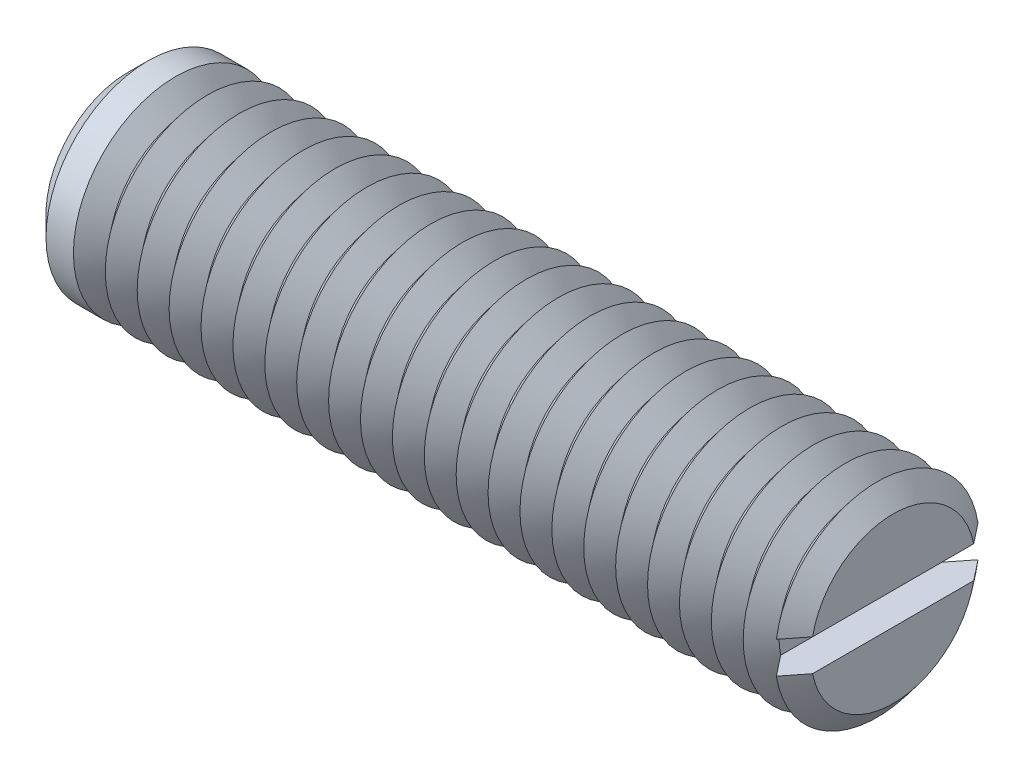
ISO-10303-21;
HEADER;
FILE_DESCRIPTION(('STEP AP214'),'2;1');
FILE_NAME('part.step','',(''),(''),'','','');
FILE_SCHEMA(('AUTOMOTIVE_DESIGN { 1 0 10303 214 1 1 1 1 }'));
ENDSEC;
DATA;
#1=APPLICATION_CONTEXT('core data for automotive mechanical design processes');
#2=APPLICATION_PROTOCOL_DEFINITION('international standard','automotive_design',2000,#1);
#3=PRODUCT_CONTEXT('',#1,'mechanical');
#4=PRODUCT('Part','Part','',(#3));
#5=PRODUCT_RELATED_PRODUCT_CATEGORY('part','',(#4));
#6=PRODUCT_DEFINITION_FORMATION('','',#4);
#7=PRODUCT_DEFINITION_CONTEXT('part definition',#1,'design');
#8=PRODUCT_DEFINITION('design','',#6,#7);
#9=PRODUCT_DEFINITION_SHAPE('','',#8);
#10=(LENGTH_UNIT() NAMED_UNIT(*) SI_UNIT(.MILLI.,.METRE.));
#11=(NAMED_UNIT(*) PLANE_ANGLE_UNIT() SI_UNIT($,.RADIAN.));
#12=(NAMED_UNIT(*) SI_UNIT($,.STERADIAN.) SOLID_ANGLE_UNIT());
#13=UNCERTAINTY_MEASURE_WITH_UNIT(LENGTH_MEASURE(1.E-05),#10,'distance_accuracy_value','');
#14=(GEOMETRIC_REPRESENTATION_CONTEXT(3) GLOBAL_UNCERTAINTY_ASSIGNED_CONTEXT((#13)) GLOBAL_UNIT_ASSIGNED_CONTEXT((#10,
#11,#12)) REPRESENTATION_CONTEXT('',''));
#15=CARTESIAN_POINT('',(0.,0.,0.));
#16=DIRECTION('',(0.,0.,1.));
#17=DIRECTION('',(1.,0.,0.));
#18=AXIS2_PLACEMENT_3D('',#15,#16,#17);
#19=CARTESIAN_POINT('',(14.375,0.,0.));
#20=DIRECTION('',(1.,0.,0.));
#21=DIRECTION('',(0.,0.,-1.));
#22=AXIS2_PLACEMENT_3D('',#19,#20,#21);
#23=CONICAL_SURFACE('',#22,4.,0.895664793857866);
#24=CARTESIAN_POINT('',(14.375,0.,0.));
#25=DIRECTION('',(-1.,0.,0.));
#26=DIRECTION('',(0.,0.,1.));
#27=AXIS2_PLACEMENT_3D('',#24,#25,#26);
#28=CIRCLE('',#27,4.);
#29=CARTESIAN_POINT('',(14.375,-0.625,-3.95087015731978));
#30=VERTEX_POINT('',#29);
#31=CARTESIAN_POINT('',(14.375,-0.625,3.95087015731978));
#32=VERTEX_POINT('',#31);
#33=EDGE_CURVE('E117',#30,#32,#28,.T.);
#34=ORIENTED_EDGE('',*,*,#33,.T.);
#35=CARTESIAN_POINT('',(18.1614902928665,-0.625,-8.70692181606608));
#36=CARTESIAN_POINT('',(17.9148555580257,-0.625,-8.39807520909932));
#37=CARTESIAN_POINT('',(17.6682552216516,-0.625,-8.08920109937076));
#38=CARTESIAN_POINT('',(17.1751408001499,-0.625,-7.4713216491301));
#39=CARTESIAN_POINT('',(16.9286267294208,-0.625,-7.16231629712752));
#40=CARTESIAN_POINT('',(16.4351922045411,-0.625,-6.54345822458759));
#41=CARTESIAN_POINT('',(16.1882721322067,-0.625,-6.23360519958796));
#42=CARTESIAN_POINT('',(15.6947157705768,-0.625,-5.61373487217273));
#43=CARTESIAN_POINT('',(15.4480794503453,-0.625,-5.30371759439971));
#44=CARTESIAN_POINT('',(15.0704817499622,-0.625,-4.82841623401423));
#45=CARTESIAN_POINT('',(14.9393680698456,-0.625,-4.66325315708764));
#46=CARTESIAN_POINT('',(14.6773052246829,-0.625,-4.33279290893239));
#47=CARTESIAN_POINT('',(14.5463560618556,-0.625,-4.16749573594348));
#48=CARTESIAN_POINT('',(14.2846416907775,-0.625,-3.83665276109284));
#49=CARTESIAN_POINT('',(14.1538765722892,-0.625,-3.67110688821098));
#50=CARTESIAN_POINT('',(13.892697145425,-0.625,-3.33975147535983));
#51=CARTESIAN_POINT('',(13.7622828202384,-0.625,-3.17394194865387));
#52=CARTESIAN_POINT('',(13.5022082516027,-0.625,-2.84217045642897));
#53=CARTESIAN_POINT('',(13.3725471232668,-0.625,-2.6762091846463));
#54=CARTESIAN_POINT('',(13.1140928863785,-0.625,-2.34356113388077));
#55=CARTESIAN_POINT('',(12.985299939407,-0.625,-2.17687422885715));
#56=CARTESIAN_POINT('',(12.7934479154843,-0.625,-1.92591523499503));
#57=CARTESIAN_POINT('',(12.7297426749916,-0.625,-1.84213757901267));
#58=CARTESIAN_POINT('',(12.6029724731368,-0.625,-1.67409978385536));
#59=CARTESIAN_POINT('',(12.5399075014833,-0.625,-1.58983965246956));
#60=CARTESIAN_POINT('',(12.4147785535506,-0.625,-1.42061659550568));
#61=CARTESIAN_POINT('',(12.3527142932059,-0.625,-1.33565388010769));
#62=CARTESIAN_POINT('',(12.2301881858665,-0.625,-1.16458302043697));
#63=CARTESIAN_POINT('',(12.1697261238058,-0.625,-1.07847503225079));
#64=CARTESIAN_POINT('',(12.0976838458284,-0.625,-0.972092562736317));
#65=CARTESIAN_POINT('',(12.0847024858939,-0.625,-0.952767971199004));
#66=CARTESIAN_POINT('',(12.0589128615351,-0.625,-0.914003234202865));
#67=CARTESIAN_POINT('',(12.0461046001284,-0.625,-0.894563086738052));
#68=CARTESIAN_POINT('',(12.0079767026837,-0.625,-0.836043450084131));
#69=CARTESIAN_POINT('',(11.9829560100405,-0.625,-0.796767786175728));
#70=CARTESIAN_POINT('',(11.9339776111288,-0.625,-0.717444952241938));
#71=CARTESIAN_POINT('',(11.9100221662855,-0.625,-0.677396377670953));
#72=CARTESIAN_POINT('',(11.8637207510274,-0.625,-0.596377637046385));
#73=CARTESIAN_POINT('',(11.841374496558,-0.625,-0.555407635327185));
#74=CARTESIAN_POINT('',(11.8059952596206,-0.625,-0.485816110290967));
#75=CARTESIAN_POINT('',(11.7923049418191,-0.625,-0.457533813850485));
#76=CARTESIAN_POINT('',(11.766378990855,-0.625,-0.40031377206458));
#77=CARTESIAN_POINT('',(11.7541438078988,-0.625,-0.371375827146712));
#78=CARTESIAN_POINT('',(11.7204304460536,-0.625,-0.283641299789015));
#79=CARTESIAN_POINT('',(11.7017774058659,-0.625,-0.22361745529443));
#80=CARTESIAN_POINT('',(11.6847644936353,-0.625,-0.139102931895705));
#81=CARTESIAN_POINT('',(11.68099555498,-0.625,-0.115688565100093));
#82=CARTESIAN_POINT('',(11.6755004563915,-0.625,-0.0686260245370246));
#83=CARTESIAN_POINT('',(11.6737732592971,-0.625,-0.0449779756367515));
#84=CARTESIAN_POINT('',(11.6724835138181,-0.625,0.00234331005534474));
#85=CARTESIAN_POINT('',(11.6729177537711,-0.625,0.0260164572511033));
#86=CARTESIAN_POINT('',(11.6759063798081,-0.625,0.0732268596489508));
#87=CARTESIAN_POINT('',(11.6784611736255,-0.625,0.096764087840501));
#88=CARTESIAN_POINT('',(11.691400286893,-0.625,0.182271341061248));
#89=CARTESIAN_POINT('',(11.7077446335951,-0.625,0.24336641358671));
#90=CARTESIAN_POINT('',(11.7388887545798,-0.625,0.33266949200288));
#91=CARTESIAN_POINT('',(11.7504419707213,-0.625,0.36217480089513));
#92=CARTESIAN_POINT('',(11.7752210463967,-0.625,0.420481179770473));
#93=CARTESIAN_POINT('',(11.7884464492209,-0.625,0.449282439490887));
#94=CARTESIAN_POINT('',(11.8174677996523,-0.625,0.508972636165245));
#95=CARTESIAN_POINT('',(11.8333885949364,-0.625,0.539799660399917));
#96=CARTESIAN_POINT('',(11.8663425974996,-0.625,0.600856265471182));
#97=CARTESIAN_POINT('',(11.8833759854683,-0.625,0.631085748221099));
#98=CARTESIAN_POINT('',(11.9357348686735,-0.625,0.721100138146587));
#99=CARTESIAN_POINT('',(11.9722948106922,-0.625,0.78016344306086));
#100=CARTESIAN_POINT('',(12.0474296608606,-0.625,0.897183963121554));
#101=CARTESIAN_POINT('',(12.0860094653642,-0.625,0.955137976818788));
#102=CARTESIAN_POINT('',(12.1644096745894,-0.625,1.07020655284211));
#103=CARTESIAN_POINT('',(12.2042302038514,-0.625,1.12732103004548));
#104=CARTESIAN_POINT('',(12.2847841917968,-0.625,1.2410852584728));
#105=CARTESIAN_POINT('',(12.3255194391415,-0.625,1.2977337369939));
#106=CARTESIAN_POINT('',(12.4075780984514,-0.625,1.41061176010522));
#107=CARTESIAN_POINT('',(12.4489015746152,-0.625,1.46684125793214));
#108=CARTESIAN_POINT('',(12.5733456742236,-0.625,1.63486189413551));
#109=CARTESIAN_POINT('',(12.6570882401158,-0.625,1.74619171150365));
#110=CARTESIAN_POINT('',(12.8245788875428,-0.625,1.96690364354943));
#111=CARTESIAN_POINT('',(12.9083166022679,-0.625,2.07629366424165));
#112=CARTESIAN_POINT('',(13.0763821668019,-0.625,2.29462016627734));
#113=CARTESIAN_POINT('',(13.1607100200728,-0.625,2.40355664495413));
#114=CARTESIAN_POINT('',(13.4142762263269,-0.625,2.72992534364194));
#115=CARTESIAN_POINT('',(13.5840912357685,-0.625,2.94690900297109));
#116=CARTESIAN_POINT('',(13.9246141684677,-0.625,3.3804240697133));
#117=CARTESIAN_POINT('',(14.0953226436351,-0.625,3.59695504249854));
#118=CARTESIAN_POINT('',(14.4371950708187,-0.625,4.02965109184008));
#119=CARTESIAN_POINT('',(14.6083590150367,-0.625,4.24581617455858));
#120=CARTESIAN_POINT('',(14.9504500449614,-0.625,4.67725748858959));
#121=CARTESIAN_POINT('',(15.1213762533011,-0.625,4.89253441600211));
#122=CARTESIAN_POINT('',(15.4634226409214,-0.625,5.32293566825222));
#123=CARTESIAN_POINT('',(15.634542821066,-0.625,5.53805999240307));
#124=CARTESIAN_POINT('',(16.1480384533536,-0.625,6.18319284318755));
#125=CARTESIAN_POINT('',(16.4906134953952,-0.625,6.61304248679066));
#126=CARTESIAN_POINT('',(16.9438892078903,-0.625,7.18140561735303));
#127=CARTESIAN_POINT('',(17.0544613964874,-0.625,7.32002163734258));
#128=CARTESIAN_POINT('',(17.2756363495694,-0.625,7.59723760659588));
#129=CARTESIAN_POINT('',(17.386239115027,-0.625,7.73583755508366));
#130=CARTESIAN_POINT('',(17.6076076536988,-0.625,8.01319622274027));
#131=CARTESIAN_POINT('',(17.7183734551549,-0.625,8.15195491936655));
#132=CARTESIAN_POINT('',(17.939920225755,-0.625,8.42945184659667));
#133=CARTESIAN_POINT('',(18.0507011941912,-0.625,8.56819007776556));
#134=CARTESIAN_POINT('',(18.1614902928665,-0.625,8.70692181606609));
#135=B_SPLINE_CURVE_WITH_KNOTS('',3,(#35,#36,#37,#38,#39,#40,#41,#42,#43,#44,#45,#46,#47,#48,
#49,#50,#51,#52,#53,#54,#55,#56,#57,#58,#59,#60,#61,#62,#63,#64,#65,#66,#67,#68,#69,#70,#71,#72,
#73,#74,#75,#76,#77,#78,#79,#80,#81,#82,#83,#84,#85,#86,#87,#88,#89,#90,#91,#92,#93,#94,#95,#96,
#97,#98,#99,#100,#101,#102,#103,#104,#105,#106,#107,#108,#109,#110,#111,#112,#113,#114,#115,
#116,#117,#118,#119,#120,#121,#122,#123,#124,#125,#126,#127,#128,#129,#130,#131,#132,#133,#134),
.UNSPECIFIED.,.F.,.F.,(4,2,2,2,2,2,2,2,2,2,2,2,2,2,2,2,2,2,2,2,2,2,2,2,2,2,2,2,2,2,2,2,2,2,2,2,
2,2,2,2,2,2,2,2,2,2,2,2,2,4),(0.,1.1857210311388,2.37158837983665,3.56020338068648,
4.74867342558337,5.38130812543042,6.01395126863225,6.64683693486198,7.27969171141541,
7.9115106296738,8.54344406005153,8.85918511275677,9.17492108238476,9.49056578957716,
9.8061679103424,9.8760068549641,9.94584701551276,10.0855382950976,10.2255132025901,
10.3654633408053,10.4596856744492,10.5539370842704,10.741396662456,10.8124690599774,
10.8835053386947,10.9544360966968,11.0253804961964,11.2137597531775,11.3088096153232,
11.403833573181,11.5078935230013,11.6119704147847,11.8202840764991,12.0291284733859,
12.2379939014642,12.4473111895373,12.6566515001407,13.0745694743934,13.487851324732,
13.9011356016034,14.7277337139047,15.5549232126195,16.3820986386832,17.2067434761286,
18.0313920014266,19.6803778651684,20.2123228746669,20.7442873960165,21.2769292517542,
21.8095515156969),.UNSPECIFIED.);
#136=CARTESIAN_POINT('',(13.75,-0.625,3.1581247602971));
#137=VERTEX_POINT('',#136);
#138=EDGE_CURVE('E109',#137,#32,#135,.T.);
#139=ORIENTED_EDGE('',*,*,#138,.F.);
#140=CARTESIAN_POINT('',(13.75,0.,0.));
#141=DIRECTION('',(-1.,0.,0.));
#142=DIRECTION('',(0.,0.,1.));
#143=AXIS2_PLACEMENT_3D('',#140,#141,#142);
#144=CIRCLE('',#143,3.2193752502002);
#145=CARTESIAN_POINT('',(13.75,-0.625,-3.1581247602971));
#146=VERTEX_POINT('',#145);
#147=EDGE_CURVE('E399',#146,#137,#144,.T.);
#148=ORIENTED_EDGE('',*,*,#147,.F.);
#149=EDGE_CURVE('E58',#30,#146,#135,.T.);
#150=ORIENTED_EDGE('',*,*,#149,.F.);
#151=EDGE_LOOP('',(#34,#139,#148,#150));
#152=FACE_BOUND('',#151,.T.);
#153=ADVANCED_FACE('F37',(#152),#23,.T.);
#154=CARTESIAN_POINT('',(14.375,0.625,3.95087015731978));
#155=VERTEX_POINT('',#154);
#156=CARTESIAN_POINT('',(14.375,0.625,-3.95087015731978));
#157=VERTEX_POINT('',#156);
#158=EDGE_CURVE('E100',#155,#157,#28,.T.);
#159=ORIENTED_EDGE('',*,*,#158,.T.);
#160=CARTESIAN_POINT('',(18.1614902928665,0.625,8.70692181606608));
#161=CARTESIAN_POINT('',(17.9148555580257,0.625,8.39807520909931));
#162=CARTESIAN_POINT('',(17.6682552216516,0.625,8.08920109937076));
#163=CARTESIAN_POINT('',(17.1751408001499,0.625,7.47132164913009));
#164=CARTESIAN_POINT('',(16.9286267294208,0.625,7.16231629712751));
#165=CARTESIAN_POINT('',(16.4351922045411,0.625,6.54345822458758));
#166=CARTESIAN_POINT('',(16.1882721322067,0.625,6.23360519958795));
#167=CARTESIAN_POINT('',(15.6947157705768,0.625,5.61373487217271));
#168=CARTESIAN_POINT('',(15.4480794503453,0.625,5.3037175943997));
#169=CARTESIAN_POINT('',(15.0704817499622,0.625,4.82841623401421));
#170=CARTESIAN_POINT('',(14.9393680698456,0.625,4.66325315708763));
#171=CARTESIAN_POINT('',(14.6773052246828,0.625,4.33279290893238));
#172=CARTESIAN_POINT('',(14.5463560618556,0.625,4.16749573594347));
#173=CARTESIAN_POINT('',(14.2846416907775,0.625,3.83665276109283));
#174=CARTESIAN_POINT('',(14.1538765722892,0.625,3.67110688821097));
#175=CARTESIAN_POINT('',(13.892697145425,0.625,3.33975147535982));
#176=CARTESIAN_POINT('',(13.7622828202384,0.625,3.17394194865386));
#177=CARTESIAN_POINT('',(13.5022082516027,0.625,2.84217045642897));
#178=CARTESIAN_POINT('',(13.3725471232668,0.625,2.6762091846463));
#179=CARTESIAN_POINT('',(13.1140928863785,0.625,2.34356113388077));
#180=CARTESIAN_POINT('',(12.985299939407,0.625,2.17687422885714));
#181=CARTESIAN_POINT('',(12.7934479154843,0.625,1.92591523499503));
#182=CARTESIAN_POINT('',(12.7297426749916,0.625,1.84213757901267));
#183=CARTESIAN_POINT('',(12.6029724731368,0.625,1.67409978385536));
#184=CARTESIAN_POINT('',(12.5399075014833,0.625,1.58983965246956));
#185=CARTESIAN_POINT('',(12.4147785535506,0.625,1.42061659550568));
#186=CARTESIAN_POINT('',(12.3527142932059,0.625,1.33565388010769));
#187=CARTESIAN_POINT('',(12.2301881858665,0.625,1.16458302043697));
#188=CARTESIAN_POINT('',(12.1697261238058,0.625,1.07847503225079));
#189=CARTESIAN_POINT('',(12.0976838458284,0.625,0.972092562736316));
#190=CARTESIAN_POINT('',(12.0847024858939,0.625,0.952767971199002));
#191=CARTESIAN_POINT('',(12.0589128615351,0.625,0.914003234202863));
#192=CARTESIAN_POINT('',(12.0461046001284,0.625,0.89456308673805));
#193=CARTESIAN_POINT('',(12.0079767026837,0.625,0.836043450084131));
#194=CARTESIAN_POINT('',(11.9829560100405,0.625,0.796767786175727));
#195=CARTESIAN_POINT('',(11.9339776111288,0.625,0.717444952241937));
#196=CARTESIAN_POINT('',(11.9100221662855,0.625,0.677396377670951));
#197=CARTESIAN_POINT('',(11.8637207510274,0.625,0.596377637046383));
#198=CARTESIAN_POINT('',(11.841374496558,0.625,0.555407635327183));
#199=CARTESIAN_POINT('',(11.8059952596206,0.625,0.485816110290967));
#200=CARTESIAN_POINT('',(11.7923049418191,0.625,0.457533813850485));
#201=CARTESIAN_POINT('',(11.766378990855,0.625,0.400313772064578));
#202=CARTESIAN_POINT('',(11.7541438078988,0.625,0.371375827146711));
#203=CARTESIAN_POINT('',(11.7204304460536,0.625,0.283641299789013));
#204=CARTESIAN_POINT('',(11.7017774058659,0.625,0.22361745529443));
#205=CARTESIAN_POINT('',(11.6847644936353,0.625,0.139102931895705));
#206=CARTESIAN_POINT('',(11.68099555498,0.625,0.115688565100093));
#207=CARTESIAN_POINT('',(11.6755004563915,0.625,0.068626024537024));
#208=CARTESIAN_POINT('',(11.6737732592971,0.625,0.0449779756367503));
#209=CARTESIAN_POINT('',(11.6724835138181,0.625,-0.00234331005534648));
#210=CARTESIAN_POINT('',(11.6729177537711,0.625,-0.026016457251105));
#211=CARTESIAN_POINT('',(11.6759063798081,0.625,-0.0732268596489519));
#212=CARTESIAN_POINT('',(11.6784611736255,0.625,-0.0967640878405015));
#213=CARTESIAN_POINT('',(11.691400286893,0.625,-0.182271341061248));
#214=CARTESIAN_POINT('',(11.7077446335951,0.625,-0.24336641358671));
#215=CARTESIAN_POINT('',(11.7388887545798,0.625,-0.332669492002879));
#216=CARTESIAN_POINT('',(11.7504419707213,0.625,-0.362174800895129));
#217=CARTESIAN_POINT('',(11.7752210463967,0.625,-0.420481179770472));
#218=CARTESIAN_POINT('',(11.7884464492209,0.625,-0.449282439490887));
#219=CARTESIAN_POINT('',(11.8174677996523,0.625,-0.508972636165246));
#220=CARTESIAN_POINT('',(11.8333885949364,0.625,-0.539799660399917));
#221=CARTESIAN_POINT('',(11.8663425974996,0.625,-0.600856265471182));
#222=CARTESIAN_POINT('',(11.8833759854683,0.625,-0.631085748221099));
#223=CARTESIAN_POINT('',(11.9357348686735,0.625,-0.721100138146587));
#224=CARTESIAN_POINT('',(11.9722948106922,0.625,-0.78016344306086));
#225=CARTESIAN_POINT('',(12.0474296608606,0.625,-0.897183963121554));
#226=CARTESIAN_POINT('',(12.0860094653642,0.625,-0.955137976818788));
#227=CARTESIAN_POINT('',(12.1644096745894,0.625,-1.07020655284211));
#228=CARTESIAN_POINT('',(12.2042302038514,0.625,-1.12732103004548));
#229=CARTESIAN_POINT('',(12.2847841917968,0.625,-1.2410852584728));
#230=CARTESIAN_POINT('',(12.3255194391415,0.625,-1.2977337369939));
#231=CARTESIAN_POINT('',(12.4075780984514,0.625,-1.41061176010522));
#232=CARTESIAN_POINT('',(12.4489015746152,0.625,-1.46684125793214));
#233=CARTESIAN_POINT('',(12.5733456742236,0.625,-1.63486189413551));
#234=CARTESIAN_POINT('',(12.6570882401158,0.625,-1.74619171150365));
#235=CARTESIAN_POINT('',(12.8245788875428,0.625,-1.96690364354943));
#236=CARTESIAN_POINT('',(12.9083166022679,0.625,-2.07629366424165));
#237=CARTESIAN_POINT('',(13.0763821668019,0.625,-2.29462016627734));
#238=CARTESIAN_POINT('',(13.1607100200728,0.625,-2.40355664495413));
#239=CARTESIAN_POINT('',(13.4142762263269,0.625,-2.72992534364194));
#240=CARTESIAN_POINT('',(13.5840912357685,0.625,-2.94690900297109));
#241=CARTESIAN_POINT('',(13.9246141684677,0.625,-3.3804240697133));
#242=CARTESIAN_POINT('',(14.0953226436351,0.625,-3.59695504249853));
#243=CARTESIAN_POINT('',(14.4371950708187,0.625,-4.02965109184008));
#244=CARTESIAN_POINT('',(14.6083590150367,0.625,-4.24581617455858));
#245=CARTESIAN_POINT('',(14.9504500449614,0.625,-4.67725748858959));
#246=CARTESIAN_POINT('',(15.1213762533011,0.625,-4.89253441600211));
#247=CARTESIAN_POINT('',(15.4634226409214,0.625,-5.32293566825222));
#248=CARTESIAN_POINT('',(15.634542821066,0.625,-5.53805999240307));
#249=CARTESIAN_POINT('',(16.1480384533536,0.625,-6.18319284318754));
#250=CARTESIAN_POINT('',(16.4906134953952,0.625,-6.61304248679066));
#251=CARTESIAN_POINT('',(16.9438892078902,0.625,-7.18140561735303));
#252=CARTESIAN_POINT('',(17.0544613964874,0.625,-7.32002163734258));
#253=CARTESIAN_POINT('',(17.2756363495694,0.625,-7.59723760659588));
#254=CARTESIAN_POINT('',(17.386239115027,0.625,-7.73583755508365));
#255=CARTESIAN_POINT('',(17.6076076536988,0.625,-8.01319622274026));
#256=CARTESIAN_POINT('',(17.7183734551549,0.625,-8.15195491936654));
#257=CARTESIAN_POINT('',(17.939920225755,0.625,-8.42945184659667));
#258=CARTESIAN_POINT('',(18.0507011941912,0.625,-8.56819007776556));
#259=CARTESIAN_POINT('',(18.1614902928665,0.625,-8.70692181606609));
#260=B_SPLINE_CURVE_WITH_KNOTS('',3,(#160,#161,#162,#163,#164,#165,#166,#167,#168,#169,#170,
#171,#172,#173,#174,#175,#176,#177,#178,#179,#180,#181,#182,#183,#184,#185,#186,#187,#188,#189,
#190,#191,#192,#193,#194,#195,#196,#197,#198,#199,#200,#201,#202,#203,#204,#205,#206,#207,#208,
#209,#210,#211,#212,#213,#214,#215,#216,#217,#218,#219,#220,#221,#222,#223,#224,#225,#226,#227,
#228,#229,#230,#231,#232,#233,#234,#235,#236,#237,#238,#239,#240,#241,#242,#243,#244,#245,#246,
#247,#248,#249,#250,#251,#252,#253,#254,#255,#256,#257,#258,#259),.UNSPECIFIED.,.F.,.F.,(4,2,2,
2,2,2,2,2,2,2,2,2,2,2,2,2,2,2,2,2,2,2,2,2,2,2,2,2,2,2,2,2,2,2,2,2,2,2,2,2,2,2,2,2,2,2,2,2,2,4),
(0.,1.18572103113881,2.37158837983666,3.56020338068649,4.74867342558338,5.38130812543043,
6.01395126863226,6.64683693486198,7.27969171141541,7.9115106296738,8.54344406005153,
8.85918511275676,9.17492108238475,9.49056578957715,9.80616791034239,9.87600685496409,
9.94584701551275,10.0855382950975,10.2255132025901,10.3654633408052,10.4596856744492,
10.5539370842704,10.741396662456,10.8124690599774,10.8835053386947,10.9544360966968,
11.0253804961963,11.2137597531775,11.3088096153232,11.403833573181,11.5078935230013,
11.6119704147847,11.8202840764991,12.0291284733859,12.2379939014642,12.4473111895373,
12.6566515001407,13.0745694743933,13.487851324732,13.9011356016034,14.7277337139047,
15.5549232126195,16.3820986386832,17.2067434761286,18.0313920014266,19.6803778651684,
20.2123228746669,20.7442873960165,21.2769292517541,21.8095515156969),.UNSPECIFIED.);
#261=CARTESIAN_POINT('',(13.75,0.625,-3.1581247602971));
#262=VERTEX_POINT('',#261);
#263=EDGE_CURVE('E110',#262,#157,#260,.T.);
#264=ORIENTED_EDGE('',*,*,#263,.F.);
#265=CARTESIAN_POINT('',(13.75,0.625,3.1581247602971));
#266=VERTEX_POINT('',#265);
#267=EDGE_CURVE('E103',#266,#262,#144,.T.);
#268=ORIENTED_EDGE('',*,*,#267,.F.);
#269=EDGE_CURVE('E97',#155,#266,#260,.T.);
#270=ORIENTED_EDGE('',*,*,#269,.F.);
#271=EDGE_LOOP('',(#159,#264,#268,#270));
#272=FACE_BOUND('',#271,.T.);
#273=ADVANCED_FACE('F99',(#272),#23,.T.);
#274=CARTESIAN_POINT('',(13.75,0.,0.));
#275=DIRECTION('',(-1.,0.,0.));
#276=DIRECTION('',(0.,0.,1.));
#277=AXIS2_PLACEMENT_3D('',#274,#275,#276);
#278=CONICAL_SURFACE('',#277,3.2193752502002,0.895664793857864);
#279=CARTESIAN_POINT('',(13.125,0.,0.));
#280=DIRECTION('',(-1.,0.,0.));
#281=DIRECTION('',(0.,0.,1.));
#282=AXIS2_PLACEMENT_3D('',#279,#280,#281);
#283=CIRCLE('',#282,4.);
#284=CARTESIAN_POINT('',(13.125,0.,4.));
#285=VERTEX_POINT('',#284);
#286=EDGE_CURVE('E385',#285,#285,#283,.T.);
#287=ORIENTED_EDGE('',*,*,#286,.F.);
#288=EDGE_LOOP('',(#287));
#289=FACE_BOUND('',#288,.T.);
#290=ORIENTED_EDGE('',*,*,#267,.T.);
#291=EDGE_CURVE('E393',#262,#146,#144,.T.);
#292=ORIENTED_EDGE('',*,*,#291,.T.);
#293=ORIENTED_EDGE('',*,*,#147,.T.);
#294=EDGE_CURVE('E391',#137,#266,#144,.T.);
#295=ORIENTED_EDGE('',*,*,#294,.T.);
#296=EDGE_LOOP('',(#290,#292,#293,#295));
#297=FACE_BOUND('',#296,.T.);
#298=ADVANCED_FACE('F166',(#289,#297),#278,.T.);
#299=CARTESIAN_POINT('',(15.,0.,0.));
#300=DIRECTION('',(1.,0.,0.));
#301=DIRECTION('',(0.,0.,-1.));
#302=AXIS2_PLACEMENT_3D('',#299,#300,#301);
#303=PLANE('',#302);
#304=CARTESIAN_POINT('',(15.,0.,0.));
#305=DIRECTION('',(-1.,0.,0.));
#306=DIRECTION('',(0.,0.,1.));
#307=AXIS2_PLACEMENT_3D('',#304,#305,#306);
#308=CIRCLE('',#307,3.2193752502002);
#309=CARTESIAN_POINT('',(15.,0.625,3.1581247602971));
#310=VERTEX_POINT('',#309);
#311=CARTESIAN_POINT('',(15.,0.625,-3.1581247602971));
#312=VERTEX_POINT('',#311);
#313=EDGE_CURVE('E158',#310,#312,#308,.T.);
#314=ORIENTED_EDGE('',*,*,#313,.F.);
#315=DIRECTION('',(0.,0.,1.));
#316=VECTOR('',#315,1.);
#317=CARTESIAN_POINT('',(15.,0.625,0.));
#318=LINE('',#317,#316);
#319=EDGE_CURVE('E122',#312,#310,#318,.T.);
#320=ORIENTED_EDGE('',*,*,#319,.F.);
#321=EDGE_LOOP('',(#314,#320));
#322=FACE_BOUND('',#321,.T.);
#323=ADVANCED_FACE('F170',(#322),#303,.T.);
#324=CARTESIAN_POINT('',(15.,-0.625,-3.1581247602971));
#325=VERTEX_POINT('',#324);
#326=CARTESIAN_POINT('',(15.,-0.625,3.1581247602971));
#327=VERTEX_POINT('',#326);
#328=EDGE_CURVE('E66',#325,#327,#308,.T.);
#329=ORIENTED_EDGE('',*,*,#328,.F.);
#330=DIRECTION('',(0.,0.,-1.));
#331=VECTOR('',#330,1.);
#332=CARTESIAN_POINT('',(15.,-0.625,0.));
#333=LINE('',#332,#331);
#334=EDGE_CURVE('E135',#327,#325,#333,.T.);
#335=ORIENTED_EDGE('',*,*,#334,.F.);
#336=EDGE_LOOP('',(#329,#335));
#337=FACE_BOUND('',#336,.T.);
#338=ADVANCED_FACE('F199',(#337),#303,.T.);
#339=CARTESIAN_POINT('',(15.,0.,0.));
#340=DIRECTION('',(-1.,0.,0.));
#341=DIRECTION('',(0.,0.,1.));
#342=AXIS2_PLACEMENT_3D('',#339,#340,#341);
#343=CONICAL_SURFACE('',#342,3.2193752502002,0.895664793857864);
#344=ORIENTED_EDGE('',*,*,#158,.F.);
#345=CARTESIAN_POINT('',(10.5885097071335,0.625,-8.70692181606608));
#346=CARTESIAN_POINT('',(10.8351444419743,0.625,-8.39807520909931));
#347=CARTESIAN_POINT('',(11.0817447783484,0.625,-8.08920109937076));
#348=CARTESIAN_POINT('',(11.57485919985,0.625,-7.47132164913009));
#349=CARTESIAN_POINT('',(11.8213732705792,0.625,-7.16231629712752));
#350=CARTESIAN_POINT('',(12.3148077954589,0.625,-6.54345822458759));
#351=CARTESIAN_POINT('',(12.5617278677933,0.625,-6.23360519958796));
#352=CARTESIAN_POINT('',(13.0552842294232,0.625,-5.61373487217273));
#353=CARTESIAN_POINT('',(13.3019205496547,0.625,-5.30371759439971));
#354=CARTESIAN_POINT('',(13.6795182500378,0.625,-4.82841623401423));
#355=CARTESIAN_POINT('',(13.8106319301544,0.625,-4.66325315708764));
#356=CARTESIAN_POINT('',(14.0726947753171,0.625,-4.33279290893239));
#357=CARTESIAN_POINT('',(14.2036439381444,0.625,-4.16749573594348));
#358=CARTESIAN_POINT('',(14.4653583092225,0.625,-3.83665276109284));
#359=CARTESIAN_POINT('',(14.5961234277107,0.625,-3.67110688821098));
#360=CARTESIAN_POINT('',(14.857302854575,0.625,-3.33975147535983));
#361=CARTESIAN_POINT('',(14.9877171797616,0.625,-3.17394194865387));
#362=CARTESIAN_POINT('',(15.2477917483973,0.625,-2.84217045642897));
#363=CARTESIAN_POINT('',(15.3774528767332,0.625,-2.6762091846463));
#364=CARTESIAN_POINT('',(15.6359071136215,0.625,-2.34356113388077));
#365=CARTESIAN_POINT('',(15.764700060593,0.625,-2.17687422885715));
#366=CARTESIAN_POINT('',(15.9565520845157,0.625,-1.92591523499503));
#367=CARTESIAN_POINT('',(16.0202573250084,0.625,-1.84213757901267));
#368=CARTESIAN_POINT('',(16.1470275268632,0.625,-1.67409978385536));
#369=CARTESIAN_POINT('',(16.2100924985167,0.625,-1.58983965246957));
#370=CARTESIAN_POINT('',(16.3352214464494,0.625,-1.42061659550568));
#371=CARTESIAN_POINT('',(16.3972857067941,0.625,-1.33565388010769));
#372=CARTESIAN_POINT('',(16.5198118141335,0.625,-1.16458302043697));
#373=CARTESIAN_POINT('',(16.5802738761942,0.625,-1.0784750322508));
#374=CARTESIAN_POINT('',(16.6523161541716,0.625,-0.972092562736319));
#375=CARTESIAN_POINT('',(16.6652975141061,0.625,-0.952767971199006));
#376=CARTESIAN_POINT('',(16.6910871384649,0.625,-0.914003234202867));
#377=CARTESIAN_POINT('',(16.7038953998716,0.625,-0.894563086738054));
#378=CARTESIAN_POINT('',(16.7420232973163,0.625,-0.836043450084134));
#379=CARTESIAN_POINT('',(16.7670439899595,0.625,-0.796767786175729));
#380=CARTESIAN_POINT('',(16.8160223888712,0.625,-0.717444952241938));
#381=CARTESIAN_POINT('',(16.8399778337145,0.625,-0.677396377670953));
#382=CARTESIAN_POINT('',(16.8862792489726,0.625,-0.596377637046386));
#383=CARTESIAN_POINT('',(16.9086255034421,0.625,-0.555407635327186));
#384=CARTESIAN_POINT('',(16.9440047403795,0.625,-0.485816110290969));
#385=CARTESIAN_POINT('',(16.9576950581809,0.625,-0.457533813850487));
#386=CARTESIAN_POINT('',(16.983621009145,0.625,-0.400313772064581));
#387=CARTESIAN_POINT('',(16.9958561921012,0.625,-0.371375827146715));
#388=CARTESIAN_POINT('',(17.0295695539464,0.625,-0.283641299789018));
#389=CARTESIAN_POINT('',(17.0482225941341,0.625,-0.223617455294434));
#390=CARTESIAN_POINT('',(17.0652355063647,0.625,-0.139102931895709));
#391=CARTESIAN_POINT('',(17.06900444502,0.625,-0.115688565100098));
#392=CARTESIAN_POINT('',(17.0744995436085,0.625,-0.0686260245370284));
#393=CARTESIAN_POINT('',(17.0762267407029,0.625,-0.0449779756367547));
#394=CARTESIAN_POINT('',(17.0775164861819,0.625,0.00234331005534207));
#395=CARTESIAN_POINT('',(17.077082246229,0.625,0.0260164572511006));
#396=CARTESIAN_POINT('',(17.0740936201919,0.625,0.0732268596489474));
#397=CARTESIAN_POINT('',(17.0715388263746,0.625,0.096764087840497));
#398=CARTESIAN_POINT('',(17.058599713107,0.625,0.182271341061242));
#399=CARTESIAN_POINT('',(17.042255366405,0.625,0.243366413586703));
#400=CARTESIAN_POINT('',(17.0111112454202,0.625,0.332669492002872));
#401=CARTESIAN_POINT('',(16.9995580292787,0.625,0.362174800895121));
#402=CARTESIAN_POINT('',(16.9747789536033,0.625,0.420481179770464));
#403=CARTESIAN_POINT('',(16.9615535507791,0.625,0.449282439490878));
#404=CARTESIAN_POINT('',(16.9325322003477,0.625,0.508972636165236));
#405=CARTESIAN_POINT('',(16.9166114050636,0.625,0.539799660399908));
#406=CARTESIAN_POINT('',(16.8836574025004,0.625,0.600856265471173));
#407=CARTESIAN_POINT('',(16.8666240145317,0.625,0.631085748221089));
#408=CARTESIAN_POINT('',(16.8142651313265,0.625,0.721100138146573));
#409=CARTESIAN_POINT('',(16.7777051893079,0.625,0.780163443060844));
#410=CARTESIAN_POINT('',(16.7025703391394,0.625,0.897183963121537));
#411=CARTESIAN_POINT('',(16.6639905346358,0.625,0.955137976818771));
#412=CARTESIAN_POINT('',(16.5855903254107,0.625,1.0702065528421));
#413=CARTESIAN_POINT('',(16.5457697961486,0.625,1.12732103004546));
#414=CARTESIAN_POINT('',(16.4652158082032,0.625,1.24108525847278));
#415=CARTESIAN_POINT('',(16.4244805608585,0.625,1.29773373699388));
#416=CARTESIAN_POINT('',(16.3424219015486,0.625,1.41061176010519));
#417=CARTESIAN_POINT('',(16.3010984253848,0.625,1.46684125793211));
#418=CARTESIAN_POINT('',(16.1766543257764,0.625,1.63486189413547));
#419=CARTESIAN_POINT('',(16.0929117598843,0.625,1.74619171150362));
#420=CARTESIAN_POINT('',(15.9254211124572,0.625,1.96690364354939));
#421=CARTESIAN_POINT('',(15.8416833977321,0.625,2.07629366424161));
#422=CARTESIAN_POINT('',(15.6736178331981,0.625,2.2946201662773));
#423=CARTESIAN_POINT('',(15.5892899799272,0.625,2.40355664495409));
#424=CARTESIAN_POINT('',(15.3357237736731,0.625,2.72992534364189));
#425=CARTESIAN_POINT('',(15.1659087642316,0.625,2.94690900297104));
#426=CARTESIAN_POINT('',(14.8253858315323,0.625,3.38042406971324));
#427=CARTESIAN_POINT('',(14.654677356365,0.625,3.59695504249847));
#428=CARTESIAN_POINT('',(14.3128049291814,0.625,4.02965109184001));
#429=CARTESIAN_POINT('',(14.1416409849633,0.625,4.2458161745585));
#430=CARTESIAN_POINT('',(13.7995499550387,0.625,4.6772574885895));
#431=CARTESIAN_POINT('',(13.6286237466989,0.625,4.89253441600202));
#432=CARTESIAN_POINT('',(13.2865773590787,0.625,5.32293566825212));
#433=CARTESIAN_POINT('',(13.1154571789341,0.625,5.53805999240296));
#434=CARTESIAN_POINT('',(12.6019615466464,0.625,6.18319284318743));
#435=CARTESIAN_POINT('',(12.2593865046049,0.625,6.61304248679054));
#436=CARTESIAN_POINT('',(11.8061107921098,0.625,7.1814056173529));
#437=CARTESIAN_POINT('',(11.6955386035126,0.625,7.32002163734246));
#438=CARTESIAN_POINT('',(11.4743636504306,0.625,7.59723760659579));
#439=CARTESIAN_POINT('',(11.363760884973,0.625,7.73583755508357));
#440=CARTESIAN_POINT('',(11.1423923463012,0.625,8.01319622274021));
#441=CARTESIAN_POINT('',(11.0316265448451,0.625,8.1519549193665));
#442=CARTESIAN_POINT('',(10.8100797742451,0.625,8.42945184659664));
#443=CARTESIAN_POINT('',(10.6992988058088,0.625,8.56819007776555));
#444=CARTESIAN_POINT('',(10.5885097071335,0.625,8.70692181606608));
#445=B_SPLINE_CURVE_WITH_KNOTS('',3,(#345,#346,#347,#348,#349,#350,#351,#352,#353,#354,#355,
#356,#357,#358,#359,#360,#361,#362,#363,#364,#365,#366,#367,#368,#369,#370,#371,#372,#373,#374,
#375,#376,#377,#378,#379,#380,#381,#382,#383,#384,#385,#386,#387,#388,#389,#390,#391,#392,#393,
#394,#395,#396,#397,#398,#399,#400,#401,#402,#403,#404,#405,#406,#407,#408,#409,#410,#411,#412,
#413,#414,#415,#416,#417,#418,#419,#420,#421,#422,#423,#424,#425,#426,#427,#428,#429,#430,#431,
#432,#433,#434,#435,#436,#437,#438,#439,#440,#441,#442,#443,#444),.UNSPECIFIED.,.F.,.F.,(4,2,2,
2,2,2,2,2,2,2,2,2,2,2,2,2,2,2,2,2,2,2,2,2,2,2,2,2,2,2,2,2,2,2,2,2,2,2,2,2,2,2,2,2,2,2,2,2,2,4),
(0.,1.1857210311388,2.37158837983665,3.56020338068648,4.74867342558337,5.38130812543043,
6.01395126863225,6.64683693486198,7.27969171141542,7.91151062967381,8.54344406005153,
8.85918511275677,9.17492108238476,9.49056578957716,9.8061679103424,9.8760068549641,
9.94584701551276,10.0855382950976,10.2255132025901,10.3654633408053,10.4596856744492,
10.5539370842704,10.741396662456,10.8124690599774,10.8835053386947,10.9544360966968,
11.0253804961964,11.2137597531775,11.3088096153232,11.403833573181,11.5078935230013,
11.6119704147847,11.8202840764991,12.0291284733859,12.2379939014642,12.4473111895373,
12.6566515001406,13.0745694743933,13.4878513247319,13.9011356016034,14.7277337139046,
15.5549232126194,16.3820986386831,17.2067434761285,18.0313920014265,19.6803778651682,
20.2123228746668,20.7442873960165,21.2769292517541,21.8095515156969),.UNSPECIFIED.);
#446=EDGE_CURVE('E41',#310,#155,#445,.T.);
#447=ORIENTED_EDGE('',*,*,#446,.F.);
#448=ORIENTED_EDGE('',*,*,#313,.T.);
#449=EDGE_CURVE('E11',#157,#312,#445,.T.);
#450=ORIENTED_EDGE('',*,*,#449,.F.);
#451=EDGE_LOOP('',(#344,#447,#448,#450));
#452=FACE_BOUND('',#451,.T.);
#453=ADVANCED_FACE('F114',(#452),#343,.T.);
#454=CARTESIAN_POINT('',(15.,0.625,-6.));
#455=DIRECTION('',(0.,1.,0.));
#456=DIRECTION('',(0.,0.,1.));
#457=AXIS2_PLACEMENT_3D('',#454,#455,#456);
#458=PLANE('',#457);
#459=ORIENTED_EDGE('',*,*,#446,.T.);
#460=ORIENTED_EDGE('',*,*,#269,.T.);
#461=DIRECTION('',(0.,0.,1.));
#462=VECTOR('',#461,1.);
#463=CARTESIAN_POINT('',(13.75,0.625,-6.));
#464=LINE('',#463,#462);
#465=EDGE_CURVE('E143',#262,#266,#464,.T.);
#466=ORIENTED_EDGE('',*,*,#465,.F.);
#467=ORIENTED_EDGE('',*,*,#263,.T.);
#468=ORIENTED_EDGE('',*,*,#449,.T.);
#469=ORIENTED_EDGE('',*,*,#319,.T.);
#470=EDGE_LOOP('',(#459,#460,#466,#467,#468,#469));
#471=FACE_BOUND('',#470,.T.);
#472=ADVANCED_FACE('F120',(#471),#458,.F.);
#473=ORIENTED_EDGE('',*,*,#33,.F.);
#474=CARTESIAN_POINT('',(10.5885097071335,-0.625,8.70692181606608));
#475=CARTESIAN_POINT('',(10.8351444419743,-0.625,8.39807520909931));
#476=CARTESIAN_POINT('',(11.0817447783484,-0.625,8.08920109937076));
#477=CARTESIAN_POINT('',(11.57485919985,-0.625,7.47132164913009));
#478=CARTESIAN_POINT('',(11.8213732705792,-0.625,7.16231629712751));
#479=CARTESIAN_POINT('',(12.3148077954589,-0.625,6.54345822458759));
#480=CARTESIAN_POINT('',(12.5617278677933,-0.625,6.23360519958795));
#481=CARTESIAN_POINT('',(13.0552842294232,-0.625,5.61373487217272));
#482=CARTESIAN_POINT('',(13.3019205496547,-0.625,5.3037175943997));
#483=CARTESIAN_POINT('',(13.6795182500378,-0.625,4.82841623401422));
#484=CARTESIAN_POINT('',(13.8106319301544,-0.625,4.66325315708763));
#485=CARTESIAN_POINT('',(14.0726947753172,-0.625,4.33279290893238));
#486=CARTESIAN_POINT('',(14.2036439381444,-0.625,4.16749573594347));
#487=CARTESIAN_POINT('',(14.4653583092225,-0.625,3.83665276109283));
#488=CARTESIAN_POINT('',(14.5961234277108,-0.625,3.67110688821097));
#489=CARTESIAN_POINT('',(14.857302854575,-0.625,3.33975147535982));
#490=CARTESIAN_POINT('',(14.9877171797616,-0.625,3.17394194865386));
#491=CARTESIAN_POINT('',(15.2477917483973,-0.625,2.84217045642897));
#492=CARTESIAN_POINT('',(15.3774528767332,-0.625,2.6762091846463));
#493=CARTESIAN_POINT('',(15.6359071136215,-0.625,2.34356113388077));
#494=CARTESIAN_POINT('',(15.764700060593,-0.625,2.17687422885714));
#495=CARTESIAN_POINT('',(15.9565520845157,-0.625,1.92591523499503));
#496=CARTESIAN_POINT('',(16.0202573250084,-0.625,1.84213757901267));
#497=CARTESIAN_POINT('',(16.1470275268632,-0.625,1.67409978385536));
#498=CARTESIAN_POINT('',(16.2100924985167,-0.625,1.58983965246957));
#499=CARTESIAN_POINT('',(16.3352214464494,-0.625,1.42061659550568));
#500=CARTESIAN_POINT('',(16.3972857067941,-0.625,1.33565388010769));
#501=CARTESIAN_POINT('',(16.5198118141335,-0.625,1.16458302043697));
#502=CARTESIAN_POINT('',(16.5802738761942,-0.625,1.0784750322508));
#503=CARTESIAN_POINT('',(16.6523161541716,-0.625,0.97209256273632));
#504=CARTESIAN_POINT('',(16.6652975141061,-0.625,0.952767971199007));
#505=CARTESIAN_POINT('',(16.691087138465,-0.625,0.914003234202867));
#506=CARTESIAN_POINT('',(16.7038953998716,-0.625,0.894563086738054));
#507=CARTESIAN_POINT('',(16.7420232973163,-0.625,0.836043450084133));
#508=CARTESIAN_POINT('',(16.7670439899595,-0.625,0.796767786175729));
#509=CARTESIAN_POINT('',(16.8160223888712,-0.625,0.717444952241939));
#510=CARTESIAN_POINT('',(16.8399778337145,-0.625,0.677396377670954));
#511=CARTESIAN_POINT('',(16.8862792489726,-0.625,0.596377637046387));
#512=CARTESIAN_POINT('',(16.9086255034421,-0.625,0.555407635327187));
#513=CARTESIAN_POINT('',(16.9440047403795,-0.625,0.485816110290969));
#514=CARTESIAN_POINT('',(16.9576950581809,-0.625,0.457533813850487));
#515=CARTESIAN_POINT('',(16.983621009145,-0.625,0.400313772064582));
#516=CARTESIAN_POINT('',(16.9958561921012,-0.625,0.371375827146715));
#517=CARTESIAN_POINT('',(17.0295695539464,-0.625,0.283641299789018));
#518=CARTESIAN_POINT('',(17.0482225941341,-0.625,0.223617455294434));
#519=CARTESIAN_POINT('',(17.0652355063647,-0.625,0.139102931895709));
#520=CARTESIAN_POINT('',(17.06900444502,-0.625,0.115688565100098));
#521=CARTESIAN_POINT('',(17.0744995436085,-0.625,0.0686260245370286));
#522=CARTESIAN_POINT('',(17.0762267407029,-0.625,0.0449779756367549));
#523=CARTESIAN_POINT('',(17.0775164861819,-0.625,-0.00234331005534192));
#524=CARTESIAN_POINT('',(17.077082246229,-0.625,-0.0260164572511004));
#525=CARTESIAN_POINT('',(17.0740936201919,-0.625,-0.0732268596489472));
#526=CARTESIAN_POINT('',(17.0715388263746,-0.625,-0.0967640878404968));
#527=CARTESIAN_POINT('',(17.058599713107,-0.625,-0.182271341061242));
#528=CARTESIAN_POINT('',(17.042255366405,-0.625,-0.243366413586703));
#529=CARTESIAN_POINT('',(17.0111112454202,-0.625,-0.332669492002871));
#530=CARTESIAN_POINT('',(16.9995580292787,-0.625,-0.362174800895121));
#531=CARTESIAN_POINT('',(16.9747789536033,-0.625,-0.420481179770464));
#532=CARTESIAN_POINT('',(16.9615535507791,-0.625,-0.449282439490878));
#533=CARTESIAN_POINT('',(16.9325322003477,-0.625,-0.508972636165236));
#534=CARTESIAN_POINT('',(16.9166114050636,-0.625,-0.539799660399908));
#535=CARTESIAN_POINT('',(16.8836574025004,-0.625,-0.600856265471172));
#536=CARTESIAN_POINT('',(16.8666240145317,-0.625,-0.63108574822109));
#537=CARTESIAN_POINT('',(16.8142651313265,-0.625,-0.721100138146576));
#538=CARTESIAN_POINT('',(16.7777051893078,-0.625,-0.780163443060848));
#539=CARTESIAN_POINT('',(16.7025703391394,-0.625,-0.897183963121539));
#540=CARTESIAN_POINT('',(16.6639905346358,-0.625,-0.955137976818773));
#541=CARTESIAN_POINT('',(16.5855903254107,-0.625,-1.0702065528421));
#542=CARTESIAN_POINT('',(16.5457697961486,-0.625,-1.12732103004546));
#543=CARTESIAN_POINT('',(16.4652158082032,-0.625,-1.24108525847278));
#544=CARTESIAN_POINT('',(16.4244805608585,-0.625,-1.29773373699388));
#545=CARTESIAN_POINT('',(16.3424219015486,-0.625,-1.41061176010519));
#546=CARTESIAN_POINT('',(16.3010984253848,-0.625,-1.46684125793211));
#547=CARTESIAN_POINT('',(16.1766543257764,-0.625,-1.63486189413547));
#548=CARTESIAN_POINT('',(16.0929117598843,-0.625,-1.74619171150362));
#549=CARTESIAN_POINT('',(15.9254211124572,-0.625,-1.96690364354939));
#550=CARTESIAN_POINT('',(15.8416833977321,-0.625,-2.07629366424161));
#551=CARTESIAN_POINT('',(15.6736178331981,-0.625,-2.2946201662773));
#552=CARTESIAN_POINT('',(15.5892899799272,-0.625,-2.40355664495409));
#553=CARTESIAN_POINT('',(15.3357237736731,-0.625,-2.72992534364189));
#554=CARTESIAN_POINT('',(15.1659087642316,-0.625,-2.94690900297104));
#555=CARTESIAN_POINT('',(14.8253858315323,-0.625,-3.38042406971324));
#556=CARTESIAN_POINT('',(14.654677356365,-0.625,-3.59695504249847));
#557=CARTESIAN_POINT('',(14.3128049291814,-0.625,-4.02965109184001));
#558=CARTESIAN_POINT('',(14.1416409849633,-0.625,-4.2458161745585));
#559=CARTESIAN_POINT('',(13.7995499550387,-0.625,-4.6772574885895));
#560=CARTESIAN_POINT('',(13.6286237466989,-0.625,-4.89253441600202));
#561=CARTESIAN_POINT('',(13.2865773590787,-0.625,-5.32293566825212));
#562=CARTESIAN_POINT('',(13.1154571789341,-0.625,-5.53805999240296));
#563=CARTESIAN_POINT('',(12.6019615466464,-0.625,-6.18319284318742));
#564=CARTESIAN_POINT('',(12.2593865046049,-0.625,-6.61304248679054));
#565=CARTESIAN_POINT('',(11.8061107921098,-0.625,-7.1814056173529));
#566=CARTESIAN_POINT('',(11.6955386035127,-0.625,-7.32002163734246));
#567=CARTESIAN_POINT('',(11.4743636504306,-0.625,-7.59723760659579));
#568=CARTESIAN_POINT('',(11.363760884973,-0.625,-7.73583755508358));
#569=CARTESIAN_POINT('',(11.1423923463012,-0.625,-8.01319622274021));
#570=CARTESIAN_POINT('',(11.0316265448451,-0.625,-8.1519549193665));
#571=CARTESIAN_POINT('',(10.810079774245,-0.625,-8.42945184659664));
#572=CARTESIAN_POINT('',(10.6992988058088,-0.625,-8.56819007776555));
#573=CARTESIAN_POINT('',(10.5885097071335,-0.625,-8.70692181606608));
#574=B_SPLINE_CURVE_WITH_KNOTS('',3,(#474,#475,#476,#477,#478,#479,#480,#481,#482,#483,#484,
#485,#486,#487,#488,#489,#490,#491,#492,#493,#494,#495,#496,#497,#498,#499,#500,#501,#502,#503,
#504,#505,#506,#507,#508,#509,#510,#511,#512,#513,#514,#515,#516,#517,#518,#519,#520,#521,#522,
#523,#524,#525,#526,#527,#528,#529,#530,#531,#532,#533,#534,#535,#536,#537,#538,#539,#540,#541,
#542,#543,#544,#545,#546,#547,#548,#549,#550,#551,#552,#553,#554,#555,#556,#557,#558,#559,#560,
#561,#562,#563,#564,#565,#566,#567,#568,#569,#570,#571,#572,#573),.UNSPECIFIED.,.F.,.F.,(4,2,2,
2,2,2,2,2,2,2,2,2,2,2,2,2,2,2,2,2,2,2,2,2,2,2,2,2,2,2,2,2,2,2,2,2,2,2,2,2,2,2,2,2,2,2,2,2,2,4),
(0.,1.18572103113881,2.37158837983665,3.56020338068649,4.74867342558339,5.38130812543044,
6.01395126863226,6.64683693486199,7.27969171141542,7.91151062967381,8.54344406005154,
8.85918511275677,9.17492108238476,9.49056578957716,9.8061679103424,9.8760068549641,
9.94584701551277,10.0855382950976,10.2255132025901,10.3654633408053,10.4596856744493,
10.5539370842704,10.741396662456,10.8124690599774,10.8835053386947,10.9544360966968,
11.0253804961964,11.2137597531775,11.3088096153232,11.403833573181,11.5078935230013,
11.6119704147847,11.8202840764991,12.0291284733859,12.2379939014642,12.4473111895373,
12.6566515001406,13.0745694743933,13.4878513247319,13.9011356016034,14.7277337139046,
15.5549232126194,16.3820986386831,17.2067434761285,18.0313920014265,19.6803778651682,
20.2123228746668,20.7442873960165,21.2769292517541,21.8095515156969),.UNSPECIFIED.);
#575=EDGE_CURVE('E150',#325,#30,#574,.T.);
#576=ORIENTED_EDGE('',*,*,#575,.F.);
#577=ORIENTED_EDGE('',*,*,#328,.T.);
#578=EDGE_CURVE('E146',#32,#327,#574,.T.);
#579=ORIENTED_EDGE('',*,*,#578,.F.);
#580=EDGE_LOOP('',(#473,#576,#577,#579));
#581=FACE_BOUND('',#580,.T.);
#582=ADVANCED_FACE('F162',(#581),#343,.T.);
#583=CARTESIAN_POINT('',(15.,-0.625,-6.));
#584=DIRECTION('',(0.,-1.,0.));
#585=DIRECTION('',(0.,0.,-1.));
#586=AXIS2_PLACEMENT_3D('',#583,#584,#585);
#587=PLANE('',#586);
#588=ORIENTED_EDGE('',*,*,#575,.T.);
#589=ORIENTED_EDGE('',*,*,#149,.T.);
#590=DIRECTION('',(0.,0.,1.));
#591=VECTOR('',#590,1.);
#592=CARTESIAN_POINT('',(13.75,-0.625,-6.));
#593=LINE('',#592,#591);
#594=EDGE_CURVE('E142',#146,#137,#593,.T.);
#595=ORIENTED_EDGE('',*,*,#594,.T.);
#596=ORIENTED_EDGE('',*,*,#138,.T.);
#597=ORIENTED_EDGE('',*,*,#578,.T.);
#598=ORIENTED_EDGE('',*,*,#334,.T.);
#599=EDGE_LOOP('',(#588,#589,#595,#596,#597,#598));
#600=FACE_BOUND('',#599,.T.);
#601=ADVANCED_FACE('F159',(#600),#587,.F.);
#602=CARTESIAN_POINT('',(13.75,0.625,-6.));
#603=DIRECTION('',(-1.,0.,0.));
#604=DIRECTION('',(0.,0.,1.));
#605=AXIS2_PLACEMENT_3D('',#602,#603,#604);
#606=PLANE('',#605);
#607=ORIENTED_EDGE('',*,*,#594,.F.);
#608=ORIENTED_EDGE('',*,*,#291,.F.);
#609=ORIENTED_EDGE('',*,*,#465,.T.);
#610=ORIENTED_EDGE('',*,*,#294,.F.);
#611=EDGE_LOOP('',(#607,#608,#609,#610));
#612=FACE_BOUND('',#611,.T.);
#613=ADVANCED_FACE('F405',(#612),#606,.F.);
#614=CARTESIAN_POINT('',(12.5,0.,0.));
#615=DIRECTION('',(-1.,0.,0.));
#616=DIRECTION('',(0.,0.,1.));
#617=AXIS2_PLACEMENT_3D('',#614,#615,#616);
#618=CONICAL_SURFACE('',#617,3.2193752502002,0.895664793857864);
#619=CARTESIAN_POINT('',(11.875,0.,0.));
#620=DIRECTION('',(-1.,0.,0.));
#621=DIRECTION('',(0.,0.,1.));
#622=AXIS2_PLACEMENT_3D('',#619,#620,#621);
#623=CIRCLE('',#622,4.);
#624=CARTESIAN_POINT('',(11.875,0.,4.));
#625=VERTEX_POINT('',#624);
#626=EDGE_CURVE('E378',#625,#625,#623,.T.);
#627=ORIENTED_EDGE('',*,*,#626,.F.);
#628=EDGE_LOOP('',(#627));
#629=FACE_BOUND('',#628,.T.);
#630=CARTESIAN_POINT('',(12.5,0.,0.));
#631=DIRECTION('',(-1.,0.,0.));
#632=DIRECTION('',(0.,0.,1.));
#633=AXIS2_PLACEMENT_3D('',#630,#631,#632);
#634=CIRCLE('',#633,3.2193752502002);
#635=CARTESIAN_POINT('',(12.5,0.,3.2193752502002));
#636=VERTEX_POINT('',#635);
#637=EDGE_CURVE('E389',#636,#636,#634,.T.);
#638=ORIENTED_EDGE('',*,*,#637,.T.);
#639=EDGE_LOOP('',(#638));
#640=FACE_BOUND('',#639,.T.);
#641=ADVANCED_FACE('F175',(#629,#640),#618,.T.);
#642=CARTESIAN_POINT('',(13.125,0.,0.));
#643=DIRECTION('',(1.,0.,0.));
#644=DIRECTION('',(0.,0.,-1.));
#645=AXIS2_PLACEMENT_3D('',#642,#643,#644);
#646=CONICAL_SURFACE('',#645,4.,0.895664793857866);
#647=ORIENTED_EDGE('',*,*,#637,.F.);
#648=EDGE_LOOP('',(#647));
#649=FACE_BOUND('',#648,.T.);
#650=ORIENTED_EDGE('',*,*,#286,.T.);
#651=EDGE_LOOP('',(#650));
#652=FACE_BOUND('',#651,.T.);
#653=ADVANCED_FACE('F411',(#649,#652),#646,.T.);
#654=CARTESIAN_POINT('',(11.25,0.,0.));
#655=DIRECTION('',(-1.,0.,0.));
#656=DIRECTION('',(0.,0.,1.));
#657=AXIS2_PLACEMENT_3D('',#654,#655,#656);
#658=CONICAL_SURFACE('',#657,3.2193752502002,0.895664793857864);
#659=CARTESIAN_POINT('',(10.625,0.,0.));
#660=DIRECTION('',(-1.,0.,0.));
#661=DIRECTION('',(0.,0.,1.));
#662=AXIS2_PLACEMENT_3D('',#659,#660,#661);
#663=CIRCLE('',#662,4.);
#664=CARTESIAN_POINT('',(10.625,0.,4.));
#665=VERTEX_POINT('',#664);
#666=EDGE_CURVE('E370',#665,#665,#663,.T.);
#667=ORIENTED_EDGE('',*,*,#666,.F.);
#668=EDGE_LOOP('',(#667));
#669=FACE_BOUND('',#668,.T.);
#670=CARTESIAN_POINT('',(11.25,0.,0.));
#671=DIRECTION('',(-1.,0.,0.));
#672=DIRECTION('',(0.,0.,1.));
#673=AXIS2_PLACEMENT_3D('',#670,#671,#672);
#674=CIRCLE('',#673,3.2193752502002);
#675=CARTESIAN_POINT('',(11.25,0.,3.2193752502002));
#676=VERTEX_POINT('',#675);
#677=EDGE_CURVE('E381',#676,#676,#674,.T.);
#678=ORIENTED_EDGE('',*,*,#677,.T.);
#679=EDGE_LOOP('',(#678));
#680=FACE_BOUND('',#679,.T.);
#681=ADVANCED_FACE('F475',(#669,#680),#658,.T.);
#682=CARTESIAN_POINT('',(11.875,0.,0.));
#683=DIRECTION('',(1.,0.,0.));
#684=DIRECTION('',(0.,0.,-1.));
#685=AXIS2_PLACEMENT_3D('',#682,#683,#684);
#686=CONICAL_SURFACE('',#685,4.,0.895664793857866);
#687=ORIENTED_EDGE('',*,*,#677,.F.);
#688=EDGE_LOOP('',(#687));
#689=FACE_BOUND('',#688,.T.);
#690=ORIENTED_EDGE('',*,*,#626,.T.);
#691=EDGE_LOOP('',(#690));
#692=FACE_BOUND('',#691,.T.);
#693=ADVANCED_FACE('F484',(#689,#692),#686,.T.);
#694=CARTESIAN_POINT('',(10.,0.,0.));
#695=DIRECTION('',(-1.,0.,0.));
#696=DIRECTION('',(0.,0.,1.));
#697=AXIS2_PLACEMENT_3D('',#694,#695,#696);
#698=CONICAL_SURFACE('',#697,3.2193752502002,0.895664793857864);
#699=CARTESIAN_POINT('',(9.375,0.,0.));
#700=DIRECTION('',(-1.,0.,0.));
#701=DIRECTION('',(0.,0.,1.));
#702=AXIS2_PLACEMENT_3D('',#699,#700,#701);
#703=CIRCLE('',#702,4.);
#704=CARTESIAN_POINT('',(9.375,0.,4.));
#705=VERTEX_POINT('',#704);
#706=EDGE_CURVE('E363',#705,#705,#703,.T.);
#707=ORIENTED_EDGE('',*,*,#706,.F.);
#708=EDGE_LOOP('',(#707));
#709=FACE_BOUND('',#708,.T.);
#710=CARTESIAN_POINT('',(10.,0.,0.));
#711=DIRECTION('',(-1.,0.,0.));
#712=DIRECTION('',(0.,0.,1.));
#713=AXIS2_PLACEMENT_3D('',#710,#711,#712);
#714=CIRCLE('',#713,3.2193752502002);
#715=CARTESIAN_POINT('',(10.,0.,3.2193752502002));
#716=VERTEX_POINT('',#715);
#717=EDGE_CURVE('E374',#716,#716,#714,.T.);
#718=ORIENTED_EDGE('',*,*,#717,.T.);
#719=EDGE_LOOP('',(#718));
#720=FACE_BOUND('',#719,.T.);
#721=ADVANCED_FACE('F494',(#709,#720),#698,.T.);
#722=CARTESIAN_POINT('',(10.625,0.,0.));
#723=DIRECTION('',(1.,0.,0.));
#724=DIRECTION('',(0.,0.,-1.));
#725=AXIS2_PLACEMENT_3D('',#722,#723,#724);
#726=CONICAL_SURFACE('',#725,4.,0.895664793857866);
#727=ORIENTED_EDGE('',*,*,#717,.F.);
#728=EDGE_LOOP('',(#727));
#729=FACE_BOUND('',#728,.T.);
#730=ORIENTED_EDGE('',*,*,#666,.T.);
#731=EDGE_LOOP('',(#730));
#732=FACE_BOUND('',#731,.T.);
#733=ADVANCED_FACE('F504',(#729,#732),#726,.T.);
#734=CARTESIAN_POINT('',(8.75,0.,0.));
#735=DIRECTION('',(-1.,0.,0.));
#736=DIRECTION('',(0.,0.,1.));
#737=AXIS2_PLACEMENT_3D('',#734,#735,#736);
#738=CONICAL_SURFACE('',#737,3.2193752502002,0.895664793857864);
#739=CARTESIAN_POINT('',(8.125,0.,0.));
#740=DIRECTION('',(-1.,0.,0.));
#741=DIRECTION('',(0.,0.,1.));
#742=AXIS2_PLACEMENT_3D('',#739,#740,#741);
#743=CIRCLE('',#742,4.);
#744=CARTESIAN_POINT('',(8.125,0.,4.));
#745=VERTEX_POINT('',#744);
#746=EDGE_CURVE('E355',#745,#745,#743,.T.);
#747=ORIENTED_EDGE('',*,*,#746,.F.);
#748=EDGE_LOOP('',(#747));
#749=FACE_BOUND('',#748,.T.);
#750=CARTESIAN_POINT('',(8.75,0.,0.));
#751=DIRECTION('',(-1.,0.,0.));
#752=DIRECTION('',(0.,0.,1.));
#753=AXIS2_PLACEMENT_3D('',#750,#751,#752);
#754=CIRCLE('',#753,3.2193752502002);
#755=CARTESIAN_POINT('',(8.75,0.,3.2193752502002));
#756=VERTEX_POINT('',#755);
#757=EDGE_CURVE('E367',#756,#756,#754,.T.);
#758=ORIENTED_EDGE('',*,*,#757,.T.);
#759=EDGE_LOOP('',(#758));
#760=FACE_BOUND('',#759,.T.);
#761=ADVANCED_FACE('F514',(#749,#760),#738,.T.);
#762=CARTESIAN_POINT('',(9.375,0.,0.));
#763=DIRECTION('',(1.,0.,0.));
#764=DIRECTION('',(0.,0.,-1.));
#765=AXIS2_PLACEMENT_3D('',#762,#763,#764);
#766=CONICAL_SURFACE('',#765,4.,0.895664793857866);
#767=ORIENTED_EDGE('',*,*,#757,.F.);
#768=EDGE_LOOP('',(#767));
#769=FACE_BOUND('',#768,.T.);
#770=ORIENTED_EDGE('',*,*,#706,.T.);
#771=EDGE_LOOP('',(#770));
#772=FACE_BOUND('',#771,.T.);
#773=ADVANCED_FACE('F524',(#769,#772),#766,.T.);
#774=CARTESIAN_POINT('',(7.5,0.,0.));
#775=DIRECTION('',(-1.,0.,0.));
#776=DIRECTION('',(0.,0.,1.));
#777=AXIS2_PLACEMENT_3D('',#774,#775,#776);
#778=CONICAL_SURFACE('',#777,3.2193752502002,0.895664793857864);
#779=CARTESIAN_POINT('',(6.875,0.,0.));
#780=DIRECTION('',(-1.,0.,0.));
#781=DIRECTION('',(0.,0.,1.));
#782=AXIS2_PLACEMENT_3D('',#779,#780,#781);
#783=CIRCLE('',#782,4.);
#784=CARTESIAN_POINT('',(6.875,0.,4.));
#785=VERTEX_POINT('',#784);
#786=EDGE_CURVE('E348',#785,#785,#783,.T.);
#787=ORIENTED_EDGE('',*,*,#786,.F.);
#788=EDGE_LOOP('',(#787));
#789=FACE_BOUND('',#788,.T.);
#790=CARTESIAN_POINT('',(7.5,0.,0.));
#791=DIRECTION('',(-1.,0.,0.));
#792=DIRECTION('',(0.,0.,1.));
#793=AXIS2_PLACEMENT_3D('',#790,#791,#792);
#794=CIRCLE('',#793,3.2193752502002);
#795=CARTESIAN_POINT('',(7.5,0.,3.2193752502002));
#796=VERTEX_POINT('',#795);
#797=EDGE_CURVE('E359',#796,#796,#794,.T.);
#798=ORIENTED_EDGE('',*,*,#797,.T.);
#799=EDGE_LOOP('',(#798));
#800=FACE_BOUND('',#799,.T.);
#801=ADVANCED_FACE('F534',(#789,#800),#778,.T.);
#802=CARTESIAN_POINT('',(8.125,0.,0.));
#803=DIRECTION('',(1.,0.,0.));
#804=DIRECTION('',(0.,0.,-1.));
#805=AXIS2_PLACEMENT_3D('',#802,#803,#804);
#806=CONICAL_SURFACE('',#805,4.,0.895664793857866);
#807=ORIENTED_EDGE('',*,*,#797,.F.);
#808=EDGE_LOOP('',(#807));
#809=FACE_BOUND('',#808,.T.);
#810=ORIENTED_EDGE('',*,*,#746,.T.);
#811=EDGE_LOOP('',(#810));
#812=FACE_BOUND('',#811,.T.);
#813=ADVANCED_FACE('F544',(#809,#812),#806,.T.);
#814=CARTESIAN_POINT('',(6.25,0.,0.));
#815=DIRECTION('',(-1.,0.,0.));
#816=DIRECTION('',(0.,0.,1.));
#817=AXIS2_PLACEMENT_3D('',#814,#815,#816);
#818=CONICAL_SURFACE('',#817,3.2193752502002,0.895664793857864);
#819=CARTESIAN_POINT('',(5.625,0.,0.));
#820=DIRECTION('',(-1.,0.,0.));
#821=DIRECTION('',(0.,0.,1.));
#822=AXIS2_PLACEMENT_3D('',#819,#820,#821);
#823=CIRCLE('',#822,4.);
#824=CARTESIAN_POINT('',(5.625,0.,4.));
#825=VERTEX_POINT('',#824);
#826=EDGE_CURVE('E340',#825,#825,#823,.T.);
#827=ORIENTED_EDGE('',*,*,#826,.F.);
#828=EDGE_LOOP('',(#827));
#829=FACE_BOUND('',#828,.T.);
#830=CARTESIAN_POINT('',(6.25,0.,0.));
#831=DIRECTION('',(-1.,0.,0.));
#832=DIRECTION('',(0.,0.,1.));
#833=AXIS2_PLACEMENT_3D('',#830,#831,#832);
#834=CIRCLE('',#833,3.2193752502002);
#835=CARTESIAN_POINT('',(6.25,0.,3.2193752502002));
#836=VERTEX_POINT('',#835);
#837=EDGE_CURVE('E351',#836,#836,#834,.T.);
#838=ORIENTED_EDGE('',*,*,#837,.T.);
#839=EDGE_LOOP('',(#838));
#840=FACE_BOUND('',#839,.T.);
#841=ADVANCED_FACE('F554',(#829,#840),#818,.T.);
#842=CARTESIAN_POINT('',(6.875,0.,0.));
#843=DIRECTION('',(1.,0.,0.));
#844=DIRECTION('',(0.,0.,-1.));
#845=AXIS2_PLACEMENT_3D('',#842,#843,#844);
#846=CONICAL_SURFACE('',#845,4.,0.895664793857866);
#847=ORIENTED_EDGE('',*,*,#837,.F.);
#848=EDGE_LOOP('',(#847));
#849=FACE_BOUND('',#848,.T.);
#850=ORIENTED_EDGE('',*,*,#786,.T.);
#851=EDGE_LOOP('',(#850));
#852=FACE_BOUND('',#851,.T.);
#853=ADVANCED_FACE('F564',(#849,#852),#846,.T.);
#854=CARTESIAN_POINT('',(5.,0.,0.));
#855=DIRECTION('',(-1.,0.,0.));
#856=DIRECTION('',(0.,0.,1.));
#857=AXIS2_PLACEMENT_3D('',#854,#855,#856);
#858=CONICAL_SURFACE('',#857,3.2193752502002,0.895664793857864);
#859=CARTESIAN_POINT('',(4.375,0.,0.));
#860=DIRECTION('',(-1.,0.,0.));
#861=DIRECTION('',(0.,0.,1.));
#862=AXIS2_PLACEMENT_3D('',#859,#860,#861);
#863=CIRCLE('',#862,4.);
#864=CARTESIAN_POINT('',(4.375,0.,4.));
#865=VERTEX_POINT('',#864);
#866=EDGE_CURVE('E332',#865,#865,#863,.T.);
#867=ORIENTED_EDGE('',*,*,#866,.F.);
#868=EDGE_LOOP('',(#867));
#869=FACE_BOUND('',#868,.T.);
#870=CARTESIAN_POINT('',(5.,0.,0.));
#871=DIRECTION('',(-1.,0.,0.));
#872=DIRECTION('',(0.,0.,1.));
#873=AXIS2_PLACEMENT_3D('',#870,#871,#872);
#874=CIRCLE('',#873,3.2193752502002);
#875=CARTESIAN_POINT('',(5.,0.,3.2193752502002));
#876=VERTEX_POINT('',#875);
#877=EDGE_CURVE('E344',#876,#876,#874,.T.);
#878=ORIENTED_EDGE('',*,*,#877,.T.);
#879=EDGE_LOOP('',(#878));
#880=FACE_BOUND('',#879,.T.);
#881=ADVANCED_FACE('F574',(#869,#880),#858,.T.);
#882=CARTESIAN_POINT('',(5.625,0.,0.));
#883=DIRECTION('',(1.,0.,0.));
#884=DIRECTION('',(0.,0.,-1.));
#885=AXIS2_PLACEMENT_3D('',#882,#883,#884);
#886=CONICAL_SURFACE('',#885,4.,0.895664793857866);
#887=ORIENTED_EDGE('',*,*,#877,.F.);
#888=EDGE_LOOP('',(#887));
#889=FACE_BOUND('',#888,.T.);
#890=ORIENTED_EDGE('',*,*,#826,.T.);
#891=EDGE_LOOP('',(#890));
#892=FACE_BOUND('',#891,.T.);
#893=ADVANCED_FACE('F584',(#889,#892),#886,.T.);
#894=CARTESIAN_POINT('',(3.75,0.,0.));
#895=DIRECTION('',(-1.,0.,0.));
#896=DIRECTION('',(0.,0.,1.));
#897=AXIS2_PLACEMENT_3D('',#894,#895,#896);
#898=CONICAL_SURFACE('',#897,3.2193752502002,0.895664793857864);
#899=CARTESIAN_POINT('',(3.125,0.,0.));
#900=DIRECTION('',(-1.,0.,0.));
#901=DIRECTION('',(0.,0.,1.));
#902=AXIS2_PLACEMENT_3D('',#899,#900,#901);
#903=CIRCLE('',#902,4.);
#904=CARTESIAN_POINT('',(3.125,0.,4.));
#905=VERTEX_POINT('',#904);
#906=EDGE_CURVE('E325',#905,#905,#903,.T.);
#907=ORIENTED_EDGE('',*,*,#906,.F.);
#908=EDGE_LOOP('',(#907));
#909=FACE_BOUND('',#908,.T.);
#910=CARTESIAN_POINT('',(3.75,0.,0.));
#911=DIRECTION('',(-1.,0.,0.));
#912=DIRECTION('',(0.,0.,1.));
#913=AXIS2_PLACEMENT_3D('',#910,#911,#912);
#914=CIRCLE('',#913,3.2193752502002);
#915=CARTESIAN_POINT('',(3.75,0.,3.2193752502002));
#916=VERTEX_POINT('',#915);
#917=EDGE_CURVE('E336',#916,#916,#914,.T.);
#918=ORIENTED_EDGE('',*,*,#917,.T.);
#919=EDGE_LOOP('',(#918));
#920=FACE_BOUND('',#919,.T.);
#921=ADVANCED_FACE('F594',(#909,#920),#898,.T.);
#922=CARTESIAN_POINT('',(4.375,0.,0.));
#923=DIRECTION('',(1.,0.,0.));
#924=DIRECTION('',(0.,0.,-1.));
#925=AXIS2_PLACEMENT_3D('',#922,#923,#924);
#926=CONICAL_SURFACE('',#925,4.,0.895664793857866);
#927=ORIENTED_EDGE('',*,*,#917,.F.);
#928=EDGE_LOOP('',(#927));
#929=FACE_BOUND('',#928,.T.);
#930=ORIENTED_EDGE('',*,*,#866,.T.);
#931=EDGE_LOOP('',(#930));
#932=FACE_BOUND('',#931,.T.);
#933=ADVANCED_FACE('F604',(#929,#932),#926,.T.);
#934=CARTESIAN_POINT('',(2.5,0.,0.));
#935=DIRECTION('',(-1.,0.,0.));
#936=DIRECTION('',(0.,0.,1.));
#937=AXIS2_PLACEMENT_3D('',#934,#935,#936);
#938=CONICAL_SURFACE('',#937,3.2193752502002,0.895664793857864);
#939=CARTESIAN_POINT('',(1.875,0.,0.));
#940=DIRECTION('',(-1.,0.,0.));
#941=DIRECTION('',(0.,0.,1.));
#942=AXIS2_PLACEMENT_3D('',#939,#940,#941);
#943=CIRCLE('',#942,4.);
#944=CARTESIAN_POINT('',(1.875,0.,4.));
#945=VERTEX_POINT('',#944);
#946=EDGE_CURVE('E317',#945,#945,#943,.T.);
#947=ORIENTED_EDGE('',*,*,#946,.F.);
#948=EDGE_LOOP('',(#947));
#949=FACE_BOUND('',#948,.T.);
#950=CARTESIAN_POINT('',(2.5,0.,0.));
#951=DIRECTION('',(-1.,0.,0.));
#952=DIRECTION('',(0.,0.,1.));
#953=AXIS2_PLACEMENT_3D('',#950,#951,#952);
#954=CIRCLE('',#953,3.2193752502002);
#955=CARTESIAN_POINT('',(2.5,0.,3.2193752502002));
#956=VERTEX_POINT('',#955);
#957=EDGE_CURVE('E328',#956,#956,#954,.T.);
#958=ORIENTED_EDGE('',*,*,#957,.T.);
#959=EDGE_LOOP('',(#958));
#960=FACE_BOUND('',#959,.T.);
#961=ADVANCED_FACE('F614',(#949,#960),#938,.T.);
#962=CARTESIAN_POINT('',(3.125,0.,0.));
#963=DIRECTION('',(1.,0.,0.));
#964=DIRECTION('',(0.,0.,-1.));
#965=AXIS2_PLACEMENT_3D('',#962,#963,#964);
#966=CONICAL_SURFACE('',#965,4.,0.895664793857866);
#967=ORIENTED_EDGE('',*,*,#957,.F.);
#968=EDGE_LOOP('',(#967));
#969=FACE_BOUND('',#968,.T.);
#970=ORIENTED_EDGE('',*,*,#906,.T.);
#971=EDGE_LOOP('',(#970));
#972=FACE_BOUND('',#971,.T.);
#973=ADVANCED_FACE('F624',(#969,#972),#966,.T.);
#974=CARTESIAN_POINT('',(1.25,0.,0.));
#975=DIRECTION('',(-1.,0.,0.));
#976=DIRECTION('',(0.,0.,1.));
#977=AXIS2_PLACEMENT_3D('',#974,#975,#976);
#978=CONICAL_SURFACE('',#977,3.2193752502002,0.895664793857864);
#979=CARTESIAN_POINT('',(0.624999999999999,0.,0.));
#980=DIRECTION('',(-1.,0.,0.));
#981=DIRECTION('',(0.,0.,1.));
#982=AXIS2_PLACEMENT_3D('',#979,#980,#981);
#983=CIRCLE('',#982,4.);
#984=CARTESIAN_POINT('',(0.624999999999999,0.,4.));
#985=VERTEX_POINT('',#984);
#986=EDGE_CURVE('E309',#985,#985,#983,.T.);
#987=ORIENTED_EDGE('',*,*,#986,.F.);
#988=EDGE_LOOP('',(#987));
#989=FACE_BOUND('',#988,.T.);
#990=CARTESIAN_POINT('',(1.25,0.,0.));
#991=DIRECTION('',(-1.,0.,0.));
#992=DIRECTION('',(0.,0.,1.));
#993=AXIS2_PLACEMENT_3D('',#990,#991,#992);
#994=CIRCLE('',#993,3.2193752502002);
#995=CARTESIAN_POINT('',(1.25,0.,3.2193752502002));
#996=VERTEX_POINT('',#995);
#997=EDGE_CURVE('E321',#996,#996,#994,.T.);
#998=ORIENTED_EDGE('',*,*,#997,.T.);
#999=EDGE_LOOP('',(#998));
#1000=FACE_BOUND('',#999,.T.);
#1001=ADVANCED_FACE('F634',(#989,#1000),#978,.T.);
#1002=CARTESIAN_POINT('',(1.875,0.,0.));
#1003=DIRECTION('',(1.,0.,0.));
#1004=DIRECTION('',(0.,0.,-1.));
#1005=AXIS2_PLACEMENT_3D('',#1002,#1003,#1004);
#1006=CONICAL_SURFACE('',#1005,4.,0.895664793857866);
#1007=ORIENTED_EDGE('',*,*,#997,.F.);
#1008=EDGE_LOOP('',(#1007));
#1009=FACE_BOUND('',#1008,.T.);
#1010=ORIENTED_EDGE('',*,*,#946,.T.);
#1011=EDGE_LOOP('',(#1010));
#1012=FACE_BOUND('',#1011,.T.);
#1013=ADVANCED_FACE('F644',(#1009,#1012),#1006,.T.);
#1014=CARTESIAN_POINT('',(0.,0.,0.));
#1015=DIRECTION('',(-1.,0.,0.));
#1016=DIRECTION('',(0.,0.,1.));
#1017=AXIS2_PLACEMENT_3D('',#1014,#1015,#1016);
#1018=CONICAL_SURFACE('',#1017,3.2193752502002,0.895664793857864);
#1019=CARTESIAN_POINT('',(-0.625000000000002,0.,0.));
#1020=DIRECTION('',(-1.,0.,0.));
#1021=DIRECTION('',(0.,0.,1.));
#1022=AXIS2_PLACEMENT_3D('',#1019,#1020,#1021);
#1023=CIRCLE('',#1022,4.);
#1024=CARTESIAN_POINT('',(-0.625000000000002,0.,4.));
#1025=VERTEX_POINT('',#1024);
#1026=EDGE_CURVE('E302',#1025,#1025,#1023,.T.);
#1027=ORIENTED_EDGE('',*,*,#1026,.F.);
#1028=EDGE_LOOP('',(#1027));
#1029=FACE_BOUND('',#1028,.T.);
#1030=CARTESIAN_POINT('',(0.,0.,0.));
#1031=DIRECTION('',(-1.,0.,0.));
#1032=DIRECTION('',(0.,0.,1.));
#1033=AXIS2_PLACEMENT_3D('',#1030,#1031,#1032);
#1034=CIRCLE('',#1033,3.2193752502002);
#1035=CARTESIAN_POINT('',(0.,0.,3.2193752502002));
#1036=VERTEX_POINT('',#1035);
#1037=EDGE_CURVE('E313',#1036,#1036,#1034,.T.);
#1038=ORIENTED_EDGE('',*,*,#1037,.T.);
#1039=EDGE_LOOP('',(#1038));
#1040=FACE_BOUND('',#1039,.T.);
#1041=ADVANCED_FACE('F654',(#1029,#1040),#1018,.T.);
#1042=CARTESIAN_POINT('',(0.624999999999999,0.,0.));
#1043=DIRECTION('',(1.,0.,0.));
#1044=DIRECTION('',(0.,0.,-1.));
#1045=AXIS2_PLACEMENT_3D('',#1042,#1043,#1044);
#1046=CONICAL_SURFACE('',#1045,4.,0.895664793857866);
#1047=ORIENTED_EDGE('',*,*,#1037,.F.);
#1048=EDGE_LOOP('',(#1047));
#1049=FACE_BOUND('',#1048,.T.);
#1050=ORIENTED_EDGE('',*,*,#986,.T.);
#1051=EDGE_LOOP('',(#1050));
#1052=FACE_BOUND('',#1051,.T.);
#1053=ADVANCED_FACE('F664',(#1049,#1052),#1046,.T.);
#1054=CARTESIAN_POINT('',(-1.25,0.,0.));
#1055=DIRECTION('',(-1.,0.,0.));
#1056=DIRECTION('',(0.,0.,1.));
#1057=AXIS2_PLACEMENT_3D('',#1054,#1055,#1056);
#1058=CONICAL_SURFACE('',#1057,3.2193752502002,0.895664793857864);
#1059=CARTESIAN_POINT('',(-1.875,0.,0.));
#1060=DIRECTION('',(-1.,0.,0.));
#1061=DIRECTION('',(0.,0.,1.));
#1062=AXIS2_PLACEMENT_3D('',#1059,#1060,#1061);
#1063=CIRCLE('',#1062,4.);
#1064=CARTESIAN_POINT('',(-1.875,0.,4.));
#1065=VERTEX_POINT('',#1064);
#1066=EDGE_CURVE('E294',#1065,#1065,#1063,.T.);
#1067=ORIENTED_EDGE('',*,*,#1066,.F.);
#1068=EDGE_LOOP('',(#1067));
#1069=FACE_BOUND('',#1068,.T.);
#1070=CARTESIAN_POINT('',(-1.25,0.,0.));
#1071=DIRECTION('',(-1.,0.,0.));
#1072=DIRECTION('',(0.,0.,1.));
#1073=AXIS2_PLACEMENT_3D('',#1070,#1071,#1072);
#1074=CIRCLE('',#1073,3.2193752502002);
#1075=CARTESIAN_POINT('',(-1.25,0.,3.2193752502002));
#1076=VERTEX_POINT('',#1075);
#1077=EDGE_CURVE('E306',#1076,#1076,#1074,.T.);
#1078=ORIENTED_EDGE('',*,*,#1077,.T.);
#1079=EDGE_LOOP('',(#1078));
#1080=FACE_BOUND('',#1079,.T.);
#1081=ADVANCED_FACE('F674',(#1069,#1080),#1058,.T.);
#1082=CARTESIAN_POINT('',(-0.625000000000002,0.,0.));
#1083=DIRECTION('',(1.,0.,0.));
#1084=DIRECTION('',(0.,0.,-1.));
#1085=AXIS2_PLACEMENT_3D('',#1082,#1083,#1084);
#1086=CONICAL_SURFACE('',#1085,4.,0.895664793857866);
#1087=ORIENTED_EDGE('',*,*,#1077,.F.);
#1088=EDGE_LOOP('',(#1087));
#1089=FACE_BOUND('',#1088,.T.);
#1090=ORIENTED_EDGE('',*,*,#1026,.T.);
#1091=EDGE_LOOP('',(#1090));
#1092=FACE_BOUND('',#1091,.T.);
#1093=ADVANCED_FACE('F684',(#1089,#1092),#1086,.T.);
#1094=CARTESIAN_POINT('',(-2.5,0.,0.));
#1095=DIRECTION('',(-1.,0.,0.));
#1096=DIRECTION('',(0.,0.,1.));
#1097=AXIS2_PLACEMENT_3D('',#1094,#1095,#1096);
#1098=CONICAL_SURFACE('',#1097,3.2193752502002,0.895664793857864);
#1099=CARTESIAN_POINT('',(-3.125,0.,0.));
#1100=DIRECTION('',(-1.,0.,0.));
#1101=DIRECTION('',(0.,0.,1.));
#1102=AXIS2_PLACEMENT_3D('',#1099,#1100,#1101);
#1103=CIRCLE('',#1102,4.);
#1104=CARTESIAN_POINT('',(-3.125,0.,4.));
#1105=VERTEX_POINT('',#1104);
#1106=EDGE_CURVE('E286',#1105,#1105,#1103,.T.);
#1107=ORIENTED_EDGE('',*,*,#1106,.F.);
#1108=EDGE_LOOP('',(#1107));
#1109=FACE_BOUND('',#1108,.T.);
#1110=CARTESIAN_POINT('',(-2.5,0.,0.));
#1111=DIRECTION('',(-1.,0.,0.));
#1112=DIRECTION('',(0.,0.,1.));
#1113=AXIS2_PLACEMENT_3D('',#1110,#1111,#1112);
#1114=CIRCLE('',#1113,3.2193752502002);
#1115=CARTESIAN_POINT('',(-2.5,0.,3.2193752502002));
#1116=VERTEX_POINT('',#1115);
#1117=EDGE_CURVE('E298',#1116,#1116,#1114,.T.);
#1118=ORIENTED_EDGE('',*,*,#1117,.T.);
#1119=EDGE_LOOP('',(#1118));
#1120=FACE_BOUND('',#1119,.T.);
#1121=ADVANCED_FACE('F694',(#1109,#1120),#1098,.T.);
#1122=CARTESIAN_POINT('',(-1.875,0.,0.));
#1123=DIRECTION('',(1.,0.,0.));
#1124=DIRECTION('',(0.,0.,-1.));
#1125=AXIS2_PLACEMENT_3D('',#1122,#1123,#1124);
#1126=CONICAL_SURFACE('',#1125,4.,0.895664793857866);
#1127=ORIENTED_EDGE('',*,*,#1117,.F.);
#1128=EDGE_LOOP('',(#1127));
#1129=FACE_BOUND('',#1128,.T.);
#1130=ORIENTED_EDGE('',*,*,#1066,.T.);
#1131=EDGE_LOOP('',(#1130));
#1132=FACE_BOUND('',#1131,.T.);
#1133=ADVANCED_FACE('F704',(#1129,#1132),#1126,.T.);
#1134=CARTESIAN_POINT('',(-3.75,0.,0.));
#1135=DIRECTION('',(-1.,0.,0.));
#1136=DIRECTION('',(0.,0.,1.));
#1137=AXIS2_PLACEMENT_3D('',#1134,#1135,#1136);
#1138=CONICAL_SURFACE('',#1137,3.2193752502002,0.895664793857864);
#1139=CARTESIAN_POINT('',(-4.375,0.,0.));
#1140=DIRECTION('',(-1.,0.,0.));
#1141=DIRECTION('',(0.,0.,1.));
#1142=AXIS2_PLACEMENT_3D('',#1139,#1140,#1141);
#1143=CIRCLE('',#1142,4.);
#1144=CARTESIAN_POINT('',(-4.375,0.,4.));
#1145=VERTEX_POINT('',#1144);
#1146=EDGE_CURVE('E279',#1145,#1145,#1143,.T.);
#1147=ORIENTED_EDGE('',*,*,#1146,.F.);
#1148=EDGE_LOOP('',(#1147));
#1149=FACE_BOUND('',#1148,.T.);
#1150=CARTESIAN_POINT('',(-3.75,0.,0.));
#1151=DIRECTION('',(-1.,0.,0.));
#1152=DIRECTION('',(0.,0.,1.));
#1153=AXIS2_PLACEMENT_3D('',#1150,#1151,#1152);
#1154=CIRCLE('',#1153,3.2193752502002);
#1155=CARTESIAN_POINT('',(-3.75,0.,3.2193752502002));
#1156=VERTEX_POINT('',#1155);
#1157=EDGE_CURVE('E290',#1156,#1156,#1154,.T.);
#1158=ORIENTED_EDGE('',*,*,#1157,.T.);
#1159=EDGE_LOOP('',(#1158));
#1160=FACE_BOUND('',#1159,.T.);
#1161=ADVANCED_FACE('F714',(#1149,#1160),#1138,.T.);
#1162=CARTESIAN_POINT('',(-3.125,0.,0.));
#1163=DIRECTION('',(1.,0.,0.));
#1164=DIRECTION('',(0.,0.,-1.));
#1165=AXIS2_PLACEMENT_3D('',#1162,#1163,#1164);
#1166=CONICAL_SURFACE('',#1165,4.,0.895664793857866);
#1167=ORIENTED_EDGE('',*,*,#1157,.F.);
#1168=EDGE_LOOP('',(#1167));
#1169=FACE_BOUND('',#1168,.T.);
#1170=ORIENTED_EDGE('',*,*,#1106,.T.);
#1171=EDGE_LOOP('',(#1170));
#1172=FACE_BOUND('',#1171,.T.);
#1173=ADVANCED_FACE('F724',(#1169,#1172),#1166,.T.);
#1174=CARTESIAN_POINT('',(-5.,0.,0.));
#1175=DIRECTION('',(-1.,0.,0.));
#1176=DIRECTION('',(0.,0.,1.));
#1177=AXIS2_PLACEMENT_3D('',#1174,#1175,#1176);
#1178=CONICAL_SURFACE('',#1177,3.2193752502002,0.895664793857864);
#1179=CARTESIAN_POINT('',(-5.625,0.,0.));
#1180=DIRECTION('',(-1.,0.,0.));
#1181=DIRECTION('',(0.,0.,1.));
#1182=AXIS2_PLACEMENT_3D('',#1179,#1180,#1181);
#1183=CIRCLE('',#1182,4.);
#1184=CARTESIAN_POINT('',(-5.625,0.,4.));
#1185=VERTEX_POINT('',#1184);
#1186=EDGE_CURVE('E272',#1185,#1185,#1183,.T.);
#1187=ORIENTED_EDGE('',*,*,#1186,.F.);
#1188=EDGE_LOOP('',(#1187));
#1189=FACE_BOUND('',#1188,.T.);
#1190=CARTESIAN_POINT('',(-5.,0.,0.));
#1191=DIRECTION('',(-1.,0.,0.));
#1192=DIRECTION('',(0.,0.,1.));
#1193=AXIS2_PLACEMENT_3D('',#1190,#1191,#1192);
#1194=CIRCLE('',#1193,3.2193752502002);
#1195=CARTESIAN_POINT('',(-5.,0.,3.2193752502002));
#1196=VERTEX_POINT('',#1195);
#1197=EDGE_CURVE('E283',#1196,#1196,#1194,.T.);
#1198=ORIENTED_EDGE('',*,*,#1197,.T.);
#1199=EDGE_LOOP('',(#1198));
#1200=FACE_BOUND('',#1199,.T.);
#1201=ADVANCED_FACE('F734',(#1189,#1200),#1178,.T.);
#1202=CARTESIAN_POINT('',(-4.375,0.,0.));
#1203=DIRECTION('',(1.,0.,0.));
#1204=DIRECTION('',(0.,0.,-1.));
#1205=AXIS2_PLACEMENT_3D('',#1202,#1203,#1204);
#1206=CONICAL_SURFACE('',#1205,4.,0.895664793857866);
#1207=ORIENTED_EDGE('',*,*,#1197,.F.);
#1208=EDGE_LOOP('',(#1207));
#1209=FACE_BOUND('',#1208,.T.);
#1210=ORIENTED_EDGE('',*,*,#1146,.T.);
#1211=EDGE_LOOP('',(#1210));
#1212=FACE_BOUND('',#1211,.T.);
#1213=ADVANCED_FACE('F744',(#1209,#1212),#1206,.T.);
#1214=CARTESIAN_POINT('',(-6.25,0.,0.));
#1215=DIRECTION('',(-1.,0.,0.));
#1216=DIRECTION('',(0.,0.,1.));
#1217=AXIS2_PLACEMENT_3D('',#1214,#1215,#1216);
#1218=CONICAL_SURFACE('',#1217,3.2193752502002,0.895664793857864);
#1219=CARTESIAN_POINT('',(-6.875,0.,0.));
#1220=DIRECTION('',(-1.,0.,0.));
#1221=DIRECTION('',(0.,0.,1.));
#1222=AXIS2_PLACEMENT_3D('',#1219,#1220,#1221);
#1223=CIRCLE('',#1222,4.);
#1224=CARTESIAN_POINT('',(-6.875,0.,4.));
#1225=VERTEX_POINT('',#1224);
#1226=EDGE_CURVE('E264',#1225,#1225,#1223,.T.);
#1227=ORIENTED_EDGE('',*,*,#1226,.F.);
#1228=EDGE_LOOP('',(#1227));
#1229=FACE_BOUND('',#1228,.T.);
#1230=CARTESIAN_POINT('',(-6.25,0.,0.));
#1231=DIRECTION('',(-1.,0.,0.));
#1232=DIRECTION('',(0.,0.,1.));
#1233=AXIS2_PLACEMENT_3D('',#1230,#1231,#1232);
#1234=CIRCLE('',#1233,3.2193752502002);
#1235=CARTESIAN_POINT('',(-6.25,0.,3.2193752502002));
#1236=VERTEX_POINT('',#1235);
#1237=EDGE_CURVE('E276',#1236,#1236,#1234,.T.);
#1238=ORIENTED_EDGE('',*,*,#1237,.T.);
#1239=EDGE_LOOP('',(#1238));
#1240=FACE_BOUND('',#1239,.T.);
#1241=ADVANCED_FACE('F754',(#1229,#1240),#1218,.T.);
#1242=CARTESIAN_POINT('',(-5.625,0.,0.));
#1243=DIRECTION('',(1.,0.,0.));
#1244=DIRECTION('',(0.,0.,-1.));
#1245=AXIS2_PLACEMENT_3D('',#1242,#1243,#1244);
#1246=CONICAL_SURFACE('',#1245,4.,0.895664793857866);
#1247=ORIENTED_EDGE('',*,*,#1237,.F.);
#1248=EDGE_LOOP('',(#1247));
#1249=FACE_BOUND('',#1248,.T.);
#1250=ORIENTED_EDGE('',*,*,#1186,.T.);
#1251=EDGE_LOOP('',(#1250));
#1252=FACE_BOUND('',#1251,.T.);
#1253=ADVANCED_FACE('F764',(#1249,#1252),#1246,.T.);
#1254=CARTESIAN_POINT('',(-7.5,0.,0.));
#1255=DIRECTION('',(-1.,0.,0.));
#1256=DIRECTION('',(0.,0.,1.));
#1257=AXIS2_PLACEMENT_3D('',#1254,#1255,#1256);
#1258=CONICAL_SURFACE('',#1257,3.2193752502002,0.895664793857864);
#1259=CARTESIAN_POINT('',(-8.125,0.,0.));
#1260=DIRECTION('',(-1.,0.,0.));
#1261=DIRECTION('',(0.,0.,1.));
#1262=AXIS2_PLACEMENT_3D('',#1259,#1260,#1261);
#1263=CIRCLE('',#1262,4.);
#1264=CARTESIAN_POINT('',(-8.125,0.,4.));
#1265=VERTEX_POINT('',#1264);
#1266=EDGE_CURVE('E257',#1265,#1265,#1263,.T.);
#1267=ORIENTED_EDGE('',*,*,#1266,.F.);
#1268=EDGE_LOOP('',(#1267));
#1269=FACE_BOUND('',#1268,.T.);
#1270=CARTESIAN_POINT('',(-7.5,0.,0.));
#1271=DIRECTION('',(-1.,0.,0.));
#1272=DIRECTION('',(0.,0.,1.));
#1273=AXIS2_PLACEMENT_3D('',#1270,#1271,#1272);
#1274=CIRCLE('',#1273,3.2193752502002);
#1275=CARTESIAN_POINT('',(-7.5,0.,3.2193752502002));
#1276=VERTEX_POINT('',#1275);
#1277=EDGE_CURVE('E268',#1276,#1276,#1274,.T.);
#1278=ORIENTED_EDGE('',*,*,#1277,.T.);
#1279=EDGE_LOOP('',(#1278));
#1280=FACE_BOUND('',#1279,.T.);
#1281=ADVANCED_FACE('F774',(#1269,#1280),#1258,.T.);
#1282=CARTESIAN_POINT('',(-6.875,0.,0.));
#1283=DIRECTION('',(1.,0.,0.));
#1284=DIRECTION('',(0.,0.,-1.));
#1285=AXIS2_PLACEMENT_3D('',#1282,#1283,#1284);
#1286=CONICAL_SURFACE('',#1285,4.,0.895664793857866);
#1287=ORIENTED_EDGE('',*,*,#1277,.F.);
#1288=EDGE_LOOP('',(#1287));
#1289=FACE_BOUND('',#1288,.T.);
#1290=ORIENTED_EDGE('',*,*,#1226,.T.);
#1291=EDGE_LOOP('',(#1290));
#1292=FACE_BOUND('',#1291,.T.);
#1293=ADVANCED_FACE('F784',(#1289,#1292),#1286,.T.);
#1294=CARTESIAN_POINT('',(-8.75,0.,0.));
#1295=DIRECTION('',(-1.,0.,0.));
#1296=DIRECTION('',(0.,0.,1.));
#1297=AXIS2_PLACEMENT_3D('',#1294,#1295,#1296);
#1298=CONICAL_SURFACE('',#1297,3.2193752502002,0.895664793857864);
#1299=CARTESIAN_POINT('',(-9.375,0.,0.));
#1300=DIRECTION('',(-1.,0.,0.));
#1301=DIRECTION('',(0.,0.,1.));
#1302=AXIS2_PLACEMENT_3D('',#1299,#1300,#1301);
#1303=CIRCLE('',#1302,4.);
#1304=CARTESIAN_POINT('',(-9.375,0.,4.));
#1305=VERTEX_POINT('',#1304);
#1306=EDGE_CURVE('E249',#1305,#1305,#1303,.T.);
#1307=ORIENTED_EDGE('',*,*,#1306,.F.);
#1308=EDGE_LOOP('',(#1307));
#1309=FACE_BOUND('',#1308,.T.);
#1310=CARTESIAN_POINT('',(-8.75,0.,0.));
#1311=DIRECTION('',(-1.,0.,0.));
#1312=DIRECTION('',(0.,0.,1.));
#1313=AXIS2_PLACEMENT_3D('',#1310,#1311,#1312);
#1314=CIRCLE('',#1313,3.2193752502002);
#1315=CARTESIAN_POINT('',(-8.75,0.,3.2193752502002));
#1316=VERTEX_POINT('',#1315);
#1317=EDGE_CURVE('E260',#1316,#1316,#1314,.T.);
#1318=ORIENTED_EDGE('',*,*,#1317,.T.);
#1319=EDGE_LOOP('',(#1318));
#1320=FACE_BOUND('',#1319,.T.);
#1321=ADVANCED_FACE('F794',(#1309,#1320),#1298,.T.);
#1322=CARTESIAN_POINT('',(-8.125,0.,0.));
#1323=DIRECTION('',(1.,0.,0.));
#1324=DIRECTION('',(0.,0.,-1.));
#1325=AXIS2_PLACEMENT_3D('',#1322,#1323,#1324);
#1326=CONICAL_SURFACE('',#1325,4.,0.895664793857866);
#1327=ORIENTED_EDGE('',*,*,#1317,.F.);
#1328=EDGE_LOOP('',(#1327));
#1329=FACE_BOUND('',#1328,.T.);
#1330=ORIENTED_EDGE('',*,*,#1266,.T.);
#1331=EDGE_LOOP('',(#1330));
#1332=FACE_BOUND('',#1331,.T.);
#1333=ADVANCED_FACE('F804',(#1329,#1332),#1326,.T.);
#1334=CARTESIAN_POINT('',(-10.,0.,0.));
#1335=DIRECTION('',(-1.,0.,0.));
#1336=DIRECTION('',(0.,0.,1.));
#1337=AXIS2_PLACEMENT_3D('',#1334,#1335,#1336);
#1338=CONICAL_SURFACE('',#1337,3.2193752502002,0.895664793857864);
#1339=CARTESIAN_POINT('',(-10.625,0.,0.));
#1340=DIRECTION('',(-1.,0.,0.));
#1341=DIRECTION('',(0.,0.,1.));
#1342=AXIS2_PLACEMENT_3D('',#1339,#1340,#1341);
#1343=CIRCLE('',#1342,4.);
#1344=CARTESIAN_POINT('',(-10.625,0.,4.));
#1345=VERTEX_POINT('',#1344);
#1346=EDGE_CURVE('E242',#1345,#1345,#1343,.T.);
#1347=ORIENTED_EDGE('',*,*,#1346,.F.);
#1348=EDGE_LOOP('',(#1347));
#1349=FACE_BOUND('',#1348,.T.);
#1350=CARTESIAN_POINT('',(-10.,0.,0.));
#1351=DIRECTION('',(-1.,0.,0.));
#1352=DIRECTION('',(0.,0.,1.));
#1353=AXIS2_PLACEMENT_3D('',#1350,#1351,#1352);
#1354=CIRCLE('',#1353,3.2193752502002);
#1355=CARTESIAN_POINT('',(-10.,0.,3.2193752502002));
#1356=VERTEX_POINT('',#1355);
#1357=EDGE_CURVE('E253',#1356,#1356,#1354,.T.);
#1358=ORIENTED_EDGE('',*,*,#1357,.T.);
#1359=EDGE_LOOP('',(#1358));
#1360=FACE_BOUND('',#1359,.T.);
#1361=ADVANCED_FACE('F814',(#1349,#1360),#1338,.T.);
#1362=CARTESIAN_POINT('',(-9.375,0.,0.));
#1363=DIRECTION('',(1.,0.,0.));
#1364=DIRECTION('',(0.,0.,-1.));
#1365=AXIS2_PLACEMENT_3D('',#1362,#1363,#1364);
#1366=CONICAL_SURFACE('',#1365,4.,0.895664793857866);
#1367=ORIENTED_EDGE('',*,*,#1357,.F.);
#1368=EDGE_LOOP('',(#1367));
#1369=FACE_BOUND('',#1368,.T.);
#1370=ORIENTED_EDGE('',*,*,#1306,.T.);
#1371=EDGE_LOOP('',(#1370));
#1372=FACE_BOUND('',#1371,.T.);
#1373=ADVANCED_FACE('F824',(#1369,#1372),#1366,.T.);
#1374=CARTESIAN_POINT('',(-11.25,0.,0.));
#1375=DIRECTION('',(-1.,0.,0.));
#1376=DIRECTION('',(0.,0.,1.));
#1377=AXIS2_PLACEMENT_3D('',#1374,#1375,#1376);
#1378=CONICAL_SURFACE('',#1377,3.2193752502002,0.895664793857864);
#1379=CARTESIAN_POINT('',(-11.875,0.,0.));
#1380=DIRECTION('',(-1.,0.,0.));
#1381=DIRECTION('',(0.,0.,1.));
#1382=AXIS2_PLACEMENT_3D('',#1379,#1380,#1381);
#1383=CIRCLE('',#1382,4.);
#1384=CARTESIAN_POINT('',(-11.875,0.,4.));
#1385=VERTEX_POINT('',#1384);
#1386=EDGE_CURVE('E231',#1385,#1385,#1383,.T.);
#1387=ORIENTED_EDGE('',*,*,#1386,.F.);
#1388=EDGE_LOOP('',(#1387));
#1389=FACE_BOUND('',#1388,.T.);
#1390=CARTESIAN_POINT('',(-11.25,0.,0.));
#1391=DIRECTION('',(-1.,0.,0.));
#1392=DIRECTION('',(0.,0.,1.));
#1393=AXIS2_PLACEMENT_3D('',#1390,#1391,#1392);
#1394=CIRCLE('',#1393,3.2193752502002);
#1395=CARTESIAN_POINT('',(-11.25,0.,3.2193752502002));
#1396=VERTEX_POINT('',#1395);
#1397=EDGE_CURVE('E245',#1396,#1396,#1394,.T.);
#1398=ORIENTED_EDGE('',*,*,#1397,.T.);
#1399=EDGE_LOOP('',(#1398));
#1400=FACE_BOUND('',#1399,.T.);
#1401=ADVANCED_FACE('F834',(#1389,#1400),#1378,.T.);
#1402=CARTESIAN_POINT('',(-10.625,0.,0.));
#1403=DIRECTION('',(1.,0.,0.));
#1404=DIRECTION('',(0.,0.,-1.));
#1405=AXIS2_PLACEMENT_3D('',#1402,#1403,#1404);
#1406=CONICAL_SURFACE('',#1405,4.,0.895664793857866);
#1407=ORIENTED_EDGE('',*,*,#1397,.F.);
#1408=EDGE_LOOP('',(#1407));
#1409=FACE_BOUND('',#1408,.T.);
#1410=ORIENTED_EDGE('',*,*,#1346,.T.);
#1411=EDGE_LOOP('',(#1410));
#1412=FACE_BOUND('',#1411,.T.);
#1413=ADVANCED_FACE('F844',(#1409,#1412),#1406,.T.);
#1414=CARTESIAN_POINT('',(-12.5,0.,0.));
#1415=DIRECTION('',(-1.,0.,0.));
#1416=DIRECTION('',(0.,0.,1.));
#1417=AXIS2_PLACEMENT_3D('',#1414,#1415,#1416);
#1418=CONICAL_SURFACE('',#1417,3.2193752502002,0.895664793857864);
#1419=CARTESIAN_POINT('',(-13.125,0.,0.));
#1420=DIRECTION('',(-1.,0.,0.));
#1421=DIRECTION('',(0.,0.,1.));
#1422=AXIS2_PLACEMENT_3D('',#1419,#1420,#1421);
#1423=CIRCLE('',#1422,4.);
#1424=CARTESIAN_POINT('',(-13.125,0.,4.));
#1425=VERTEX_POINT('',#1424);
#1426=EDGE_CURVE('E226',#1425,#1425,#1423,.T.);
#1427=ORIENTED_EDGE('',*,*,#1426,.F.);
#1428=EDGE_LOOP('',(#1427));
#1429=FACE_BOUND('',#1428,.T.);
#1430=CARTESIAN_POINT('',(-12.5,0.,0.));
#1431=DIRECTION('',(-1.,0.,0.));
#1432=DIRECTION('',(0.,0.,1.));
#1433=AXIS2_PLACEMENT_3D('',#1430,#1431,#1432);
#1434=CIRCLE('',#1433,3.2193752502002);
#1435=CARTESIAN_POINT('',(-12.5,0.,3.2193752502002));
#1436=VERTEX_POINT('',#1435);
#1437=EDGE_CURVE('E236',#1436,#1436,#1434,.T.);
#1438=ORIENTED_EDGE('',*,*,#1437,.T.);
#1439=EDGE_LOOP('',(#1438));
#1440=FACE_BOUND('',#1439,.T.);
#1441=ADVANCED_FACE('F854',(#1429,#1440),#1418,.T.);
#1442=CARTESIAN_POINT('',(-11.875,0.,0.));
#1443=DIRECTION('',(1.,0.,0.));
#1444=DIRECTION('',(0.,0.,-1.));
#1445=AXIS2_PLACEMENT_3D('',#1442,#1443,#1444);
#1446=CONICAL_SURFACE('',#1445,4.,0.895664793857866);
#1447=ORIENTED_EDGE('',*,*,#1437,.F.);
#1448=EDGE_LOOP('',(#1447));
#1449=FACE_BOUND('',#1448,.T.);
#1450=ORIENTED_EDGE('',*,*,#1386,.T.);
#1451=EDGE_LOOP('',(#1450));
#1452=FACE_BOUND('',#1451,.T.);
#1453=ADVANCED_FACE('F215',(#1449,#1452),#1446,.T.);
#1454=CARTESIAN_POINT('',(-15.,0.,0.));
#1455=DIRECTION('',(1.,0.,0.));
#1456=DIRECTION('',(0.,0.,-1.));
#1457=AXIS2_PLACEMENT_3D('',#1454,#1455,#1456);
#1458=PLANE('',#1457);
#1459=CARTESIAN_POINT('',(-15.,0.,0.));
#1460=DIRECTION('',(1.,0.,0.));
#1461=DIRECTION('',(0.,0.,-1.));
#1462=AXIS2_PLACEMENT_3D('',#1459,#1460,#1461);
#1463=CIRCLE('',#1462,3.19999999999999);
#1464=CARTESIAN_POINT('',(-15.,0.,-3.19999999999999));
#1465=VERTEX_POINT('',#1464);
#1466=EDGE_CURVE('E124',#1465,#1465,#1463,.F.);
#1467=ORIENTED_EDGE('',*,*,#1466,.T.);
#1468=EDGE_LOOP('',(#1467));
#1469=FACE_BOUND('',#1468,.T.);
#1470=ADVANCED_FACE('F213',(#1469),#1458,.F.);
#1471=CARTESIAN_POINT('',(-14.2,0.,0.));
#1472=DIRECTION('',(1.,0.,0.));
#1473=DIRECTION('',(0.,0.,-1.));
#1474=AXIS2_PLACEMENT_3D('',#1471,#1472,#1473);
#1475=CONICAL_SURFACE('',#1474,4.,0.78539816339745);
#1476=ORIENTED_EDGE('',*,*,#1466,.F.);
#1477=EDGE_LOOP('',(#1476));
#1478=FACE_BOUND('',#1477,.T.);
#1479=CARTESIAN_POINT('',(-14.2,0.,0.));
#1480=DIRECTION('',(1.,0.,0.));
#1481=DIRECTION('',(0.,0.,-1.));
#1482=AXIS2_PLACEMENT_3D('',#1479,#1480,#1481);
#1483=CIRCLE('',#1482,4.);
#1484=CARTESIAN_POINT('',(-14.2,0.,-4.));
#1485=VERTEX_POINT('',#1484);
#1486=EDGE_CURVE('E129',#1485,#1485,#1483,.T.);
#1487=ORIENTED_EDGE('',*,*,#1486,.F.);
#1488=EDGE_LOOP('',(#1487));
#1489=FACE_BOUND('',#1488,.T.);
#1490=ADVANCED_FACE('F39',(#1478,#1489),#1475,.T.);
#1491=CARTESIAN_POINT('',(15.,0.,0.));
#1492=DIRECTION('',(-1.,0.,0.));
#1493=DIRECTION('',(0.,0.,1.));
#1494=AXIS2_PLACEMENT_3D('',#1491,#1492,#1493);
#1495=CYLINDRICAL_SURFACE('',#1494,4.);
#1496=ORIENTED_EDGE('',*,*,#1426,.T.);
#1497=EDGE_LOOP('',(#1496));
#1498=FACE_BOUND('',#1497,.T.);
#1499=ORIENTED_EDGE('',*,*,#1486,.T.);
#1500=EDGE_LOOP('',(#1499));
#1501=FACE_BOUND('',#1500,.T.);
#1502=ADVANCED_FACE('F216',(#1498,#1501),#1495,.T.);
#1503=CLOSED_SHELL('',(#153,#273,#298,#323,#338,#453,#472,#582,#601,#613,#641,#653,#681,#693,
#721,#733,#761,#773,#801,#813,#841,#853,#881,#893,#921,#933,#961,#973,#1001,#1013,#1041,#1053,
#1081,#1093,#1121,#1133,#1161,#1173,#1201,#1213,#1241,#1253,#1281,#1293,#1321,#1333,#1361,#1373,
#1401,#1413,#1441,#1453,#1470,#1490,#1502));
#1504=MANIFOLD_SOLID_BREP('B2',#1503);
#1505=ADVANCED_BREP_SHAPE_REPRESENTATION('',(#18,#1504),#14);
#1506=SHAPE_DEFINITION_REPRESENTATION(#9,#1505);
ENDSEC;
END-ISO-10303-21;
